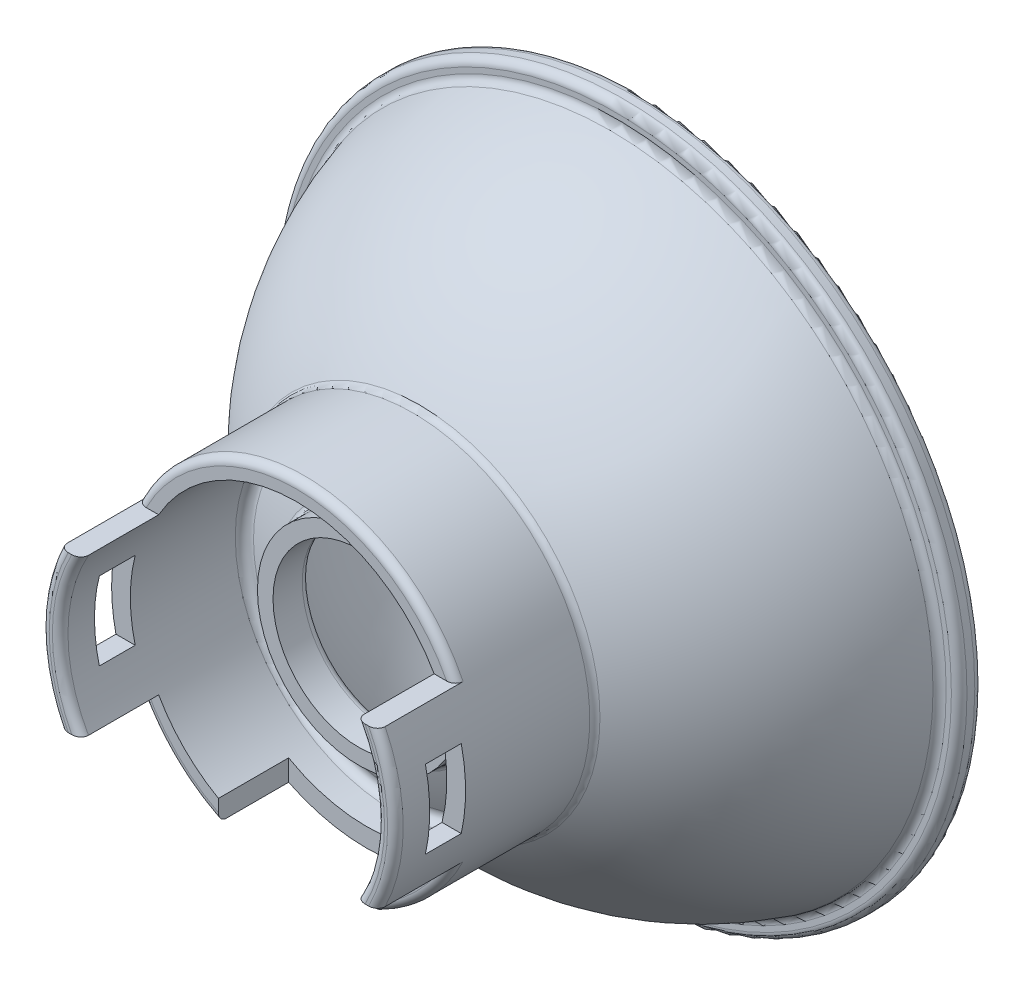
ISO-10303-21;
HEADER;
FILE_DESCRIPTION(('STEP AP214'),'2;1');
FILE_NAME('part.step','',(''),(''),'','','');
FILE_SCHEMA(('AUTOMOTIVE_DESIGN { 1 0 10303 214 1 1 1 1 }'));
ENDSEC;
DATA;
#1=APPLICATION_CONTEXT('core data for automotive mechanical design processes');
#2=APPLICATION_PROTOCOL_DEFINITION('international standard','automotive_design',2000,#1);
#3=PRODUCT_CONTEXT('',#1,'mechanical');
#4=PRODUCT('Part','Part','',(#3));
#5=PRODUCT_RELATED_PRODUCT_CATEGORY('part','',(#4));
#6=PRODUCT_DEFINITION_FORMATION('','',#4);
#7=PRODUCT_DEFINITION_CONTEXT('part definition',#1,'design');
#8=PRODUCT_DEFINITION('design','',#6,#7);
#9=PRODUCT_DEFINITION_SHAPE('','',#8);
#10=(LENGTH_UNIT() NAMED_UNIT(*) SI_UNIT(.MILLI.,.METRE.));
#11=(NAMED_UNIT(*) PLANE_ANGLE_UNIT() SI_UNIT($,.RADIAN.));
#12=(NAMED_UNIT(*) SI_UNIT($,.STERADIAN.) SOLID_ANGLE_UNIT());
#13=UNCERTAINTY_MEASURE_WITH_UNIT(LENGTH_MEASURE(1.E-05),#10,'distance_accuracy_value','');
#14=(GEOMETRIC_REPRESENTATION_CONTEXT(3) GLOBAL_UNCERTAINTY_ASSIGNED_CONTEXT((#13)) GLOBAL_UNIT_ASSIGNED_CONTEXT((#10,
#11,#12)) REPRESENTATION_CONTEXT('',''));
#15=CARTESIAN_POINT('',(0.,0.,0.));
#16=DIRECTION('',(0.,0.,1.));
#17=DIRECTION('',(1.,0.,0.));
#18=AXIS2_PLACEMENT_3D('',#15,#16,#17);
#19=CARTESIAN_POINT('',(-15.,-15.,22.));
#20=DIRECTION('',(0.,0.,1.));
#21=DIRECTION('',(1.,0.,0.));
#22=AXIS2_PLACEMENT_3D('',#19,#20,#21);
#23=PLANE('',#22);
#24=DIRECTION('',(1.,0.,0.));
#25=VECTOR('',#24,1.);
#26=CARTESIAN_POINT('',(-15.,-5.,22.));
#27=LINE('',#26,#25);
#28=CARTESIAN_POINT('',(-9.62925230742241,-5.,22.));
#29=VERTEX_POINT('',#28);
#30=CARTESIAN_POINT('',(-8.83303458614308,-5.,22.));
#31=VERTEX_POINT('',#30);
#32=EDGE_CURVE('E504',#29,#31,#27,.T.);
#33=ORIENTED_EDGE('',*,*,#32,.F.);
#34=CARTESIAN_POINT('',(0.,0.,22.));
#35=DIRECTION('',(0.,0.,1.));
#36=DIRECTION('',(1.,0.,0.));
#37=AXIS2_PLACEMENT_3D('',#34,#35,#36);
#38=CIRCLE('',#37,10.85);
#39=CARTESIAN_POINT('',(-5.,-9.62925230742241,22.));
#40=VERTEX_POINT('',#39);
#41=EDGE_CURVE('E289',#29,#40,#38,.T.);
#42=ORIENTED_EDGE('',*,*,#41,.T.);
#43=DIRECTION('',(0.,-1.,0.));
#44=VECTOR('',#43,1.);
#45=CARTESIAN_POINT('',(-5.,-15.,22.));
#46=LINE('',#45,#44);
#47=CARTESIAN_POINT('',(-5.,-8.83303458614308,22.));
#48=VERTEX_POINT('',#47);
#49=EDGE_CURVE('E220',#48,#40,#46,.T.);
#50=ORIENTED_EDGE('',*,*,#49,.F.);
#51=CARTESIAN_POINT('',(0.,0.,22.));
#52=DIRECTION('',(0.,0.,1.));
#53=DIRECTION('',(1.,0.,0.));
#54=AXIS2_PLACEMENT_3D('',#51,#52,#53);
#55=CIRCLE('',#54,10.15);
#56=EDGE_CURVE('E239',#48,#31,#55,.F.);
#57=ORIENTED_EDGE('',*,*,#56,.T.);
#58=EDGE_LOOP('',(#33,#42,#50,#57));
#59=FACE_BOUND('',#58,.T.);
#60=ADVANCED_FACE('F29',(#59),#23,.T.);
#61=CARTESIAN_POINT('',(0.,0.,0.));
#62=DIRECTION('',(0.,0.,-1.));
#63=DIRECTION('',(-1.,0.,0.));
#64=AXIS2_PLACEMENT_3D('',#61,#62,#63);
#65=CYLINDRICAL_SURFACE('',#64,11.35);
#66=CARTESIAN_POINT('',(0.,0.,14.5358436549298));
#67=DIRECTION('',(0.,0.,-1.));
#68=DIRECTION('',(-1.,0.,0.));
#69=AXIS2_PLACEMENT_3D('',#66,#67,#68);
#70=CIRCLE('',#69,11.35);
#71=CARTESIAN_POINT('',(-11.35,0.,14.5358436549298));
#72=VERTEX_POINT('',#71);
#73=EDGE_CURVE('E274',#72,#72,#70,.F.);
#74=ORIENTED_EDGE('',*,*,#73,.T.);
#75=EDGE_LOOP('',(#74));
#76=FACE_BOUND('',#75,.T.);
#77=DIRECTION('',(0.,0.,-1.));
#78=VECTOR('',#77,1.);
#79=CARTESIAN_POINT('',(10.189332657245,5.,0.));
#80=LINE('',#79,#78);
#81=CARTESIAN_POINT('',(10.189332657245,5.,26.5));
#82=VERTEX_POINT('',#81);
#83=CARTESIAN_POINT('',(10.189332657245,5.,21.5));
#84=VERTEX_POINT('',#83);
#85=EDGE_CURVE('E570',#82,#84,#80,.T.);
#86=ORIENTED_EDGE('',*,*,#85,.F.);
#87=CARTESIAN_POINT('',(0.,0.,26.5));
#88=DIRECTION('',(0.,0.,-1.));
#89=DIRECTION('',(-1.,0.,0.));
#90=AXIS2_PLACEMENT_3D('',#87,#88,#89);
#91=CIRCLE('',#90,11.35);
#92=CARTESIAN_POINT('',(10.189332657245,-5.,26.5));
#93=VERTEX_POINT('',#92);
#94=EDGE_CURVE('E452',#82,#93,#91,.T.);
#95=ORIENTED_EDGE('',*,*,#94,.T.);
#96=DIRECTION('',(0.,0.,-1.));
#97=VECTOR('',#96,1.);
#98=CARTESIAN_POINT('',(10.189332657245,-5.,0.));
#99=LINE('',#98,#97);
#100=CARTESIAN_POINT('',(10.189332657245,-5.,21.5));
#101=VERTEX_POINT('',#100);
#102=EDGE_CURVE('E559',#93,#101,#99,.T.);
#103=ORIENTED_EDGE('',*,*,#102,.T.);
#104=CARTESIAN_POINT('',(0.,0.,21.5));
#105=DIRECTION('',(0.,0.,1.));
#106=DIRECTION('',(1.,0.,0.));
#107=AXIS2_PLACEMENT_3D('',#104,#105,#106);
#108=CIRCLE('',#107,11.35);
#109=CARTESIAN_POINT('',(5.,-10.189332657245,21.5));
#110=VERTEX_POINT('',#109);
#111=EDGE_CURVE('E280',#101,#110,#108,.F.);
#112=ORIENTED_EDGE('',*,*,#111,.T.);
#113=DIRECTION('',(0.,0.,-1.));
#114=VECTOR('',#113,1.);
#115=CARTESIAN_POINT('',(5.,-10.189332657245,0.));
#116=LINE('',#115,#114);
#117=CARTESIAN_POINT('',(5.,-10.189332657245,17.5));
#118=VERTEX_POINT('',#117);
#119=EDGE_CURVE('E231',#118,#110,#116,.F.);
#120=ORIENTED_EDGE('',*,*,#119,.F.);
#121=CARTESIAN_POINT('',(0.,0.,17.5));
#122=DIRECTION('',(0.,0.,-1.));
#123=DIRECTION('',(-1.,0.,0.));
#124=AXIS2_PLACEMENT_3D('',#121,#122,#123);
#125=CIRCLE('',#124,11.35);
#126=CARTESIAN_POINT('',(-5.,-10.189332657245,17.5));
#127=VERTEX_POINT('',#126);
#128=EDGE_CURVE('E519',#127,#118,#125,.F.);
#129=ORIENTED_EDGE('',*,*,#128,.F.);
#130=DIRECTION('',(0.,0.,-1.));
#131=VECTOR('',#130,1.);
#132=CARTESIAN_POINT('',(-5.,-10.189332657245,0.));
#133=LINE('',#132,#131);
#134=CARTESIAN_POINT('',(-5.,-10.189332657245,21.5));
#135=VERTEX_POINT('',#134);
#136=EDGE_CURVE('E514',#135,#127,#133,.T.);
#137=ORIENTED_EDGE('',*,*,#136,.F.);
#138=CARTESIAN_POINT('',(0.,0.,21.5));
#139=DIRECTION('',(0.,0.,1.));
#140=DIRECTION('',(1.,0.,0.));
#141=AXIS2_PLACEMENT_3D('',#138,#139,#140);
#142=CIRCLE('',#141,11.35);
#143=CARTESIAN_POINT('',(-10.189332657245,-5.,21.5));
#144=VERTEX_POINT('',#143);
#145=EDGE_CURVE('E286',#135,#144,#142,.F.);
#146=ORIENTED_EDGE('',*,*,#145,.T.);
#147=DIRECTION('',(0.,0.,-1.));
#148=VECTOR('',#147,1.);
#149=CARTESIAN_POINT('',(-10.189332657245,-5.,0.));
#150=LINE('',#149,#148);
#151=CARTESIAN_POINT('',(-10.189332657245,-5.,26.5));
#152=VERTEX_POINT('',#151);
#153=EDGE_CURVE('E561',#144,#152,#150,.F.);
#154=ORIENTED_EDGE('',*,*,#153,.T.);
#155=CARTESIAN_POINT('',(0.,0.,26.5));
#156=DIRECTION('',(0.,0.,-1.));
#157=DIRECTION('',(-1.,0.,0.));
#158=AXIS2_PLACEMENT_3D('',#155,#156,#157);
#159=CIRCLE('',#158,11.35);
#160=CARTESIAN_POINT('',(-10.189332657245,5.,26.5));
#161=VERTEX_POINT('',#160);
#162=EDGE_CURVE('E454',#152,#161,#159,.T.);
#163=ORIENTED_EDGE('',*,*,#162,.T.);
#164=DIRECTION('',(0.,0.,-1.));
#165=VECTOR('',#164,1.);
#166=CARTESIAN_POINT('',(-10.189332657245,5.,0.));
#167=LINE('',#166,#165);
#168=CARTESIAN_POINT('',(-10.189332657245,5.,21.5));
#169=VERTEX_POINT('',#168);
#170=EDGE_CURVE('E572',#169,#161,#167,.F.);
#171=ORIENTED_EDGE('',*,*,#170,.F.);
#172=CARTESIAN_POINT('',(0.,0.,21.5));
#173=DIRECTION('',(0.,0.,1.));
#174=DIRECTION('',(1.,0.,0.));
#175=AXIS2_PLACEMENT_3D('',#172,#173,#174);
#176=CIRCLE('',#175,11.35);
#177=EDGE_CURVE('E283',#169,#84,#176,.F.);
#178=ORIENTED_EDGE('',*,*,#177,.T.);
#179=EDGE_LOOP('',(#86,#95,#103,#112,#120,#129,#137,#146,#154,#163,#171,#178));
#180=FACE_BOUND('',#179,.T.);
#181=CARTESIAN_POINT('',(0.,0.,24.8));
#182=DIRECTION('',(0.,0.,1.));
#183=DIRECTION('',(1.,0.,0.));
#184=AXIS2_PLACEMENT_3D('',#181,#182,#183);
#185=CIRCLE('',#184,11.35);
#186=CARTESIAN_POINT('',(-11.0712465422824,-2.5,24.8));
#187=VERTEX_POINT('',#186);
#188=CARTESIAN_POINT('',(-11.0712465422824,2.5,24.8));
#189=VERTEX_POINT('',#188);
#190=EDGE_CURVE('E554',#187,#189,#185,.F.);
#191=ORIENTED_EDGE('',*,*,#190,.F.);
#192=DIRECTION('',(0.,0.,-1.));
#193=VECTOR('',#192,1.);
#194=CARTESIAN_POINT('',(-11.0712465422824,-2.5,0.));
#195=LINE('',#194,#193);
#196=CARTESIAN_POINT('',(-11.0712465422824,-2.5,22.5));
#197=VERTEX_POINT('',#196);
#198=EDGE_CURVE('E543',#197,#187,#195,.F.);
#199=ORIENTED_EDGE('',*,*,#198,.F.);
#200=CARTESIAN_POINT('',(0.,0.,22.5));
#201=DIRECTION('',(0.,0.,-1.));
#202=DIRECTION('',(0.,1.,0.));
#203=AXIS2_PLACEMENT_3D('',#200,#201,#202);
#204=CIRCLE('',#203,11.35);
#205=CARTESIAN_POINT('',(-11.0712465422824,2.5,22.5));
#206=VERTEX_POINT('',#205);
#207=EDGE_CURVE('E547',#206,#197,#204,.F.);
#208=ORIENTED_EDGE('',*,*,#207,.F.);
#209=DIRECTION('',(0.,0.,-1.));
#210=VECTOR('',#209,1.);
#211=CARTESIAN_POINT('',(-11.0712465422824,2.5,0.));
#212=LINE('',#211,#210);
#213=EDGE_CURVE('E548',#189,#206,#212,.T.);
#214=ORIENTED_EDGE('',*,*,#213,.F.);
#215=EDGE_LOOP('',(#191,#199,#208,#214));
#216=FACE_BOUND('',#215,.T.);
#217=CARTESIAN_POINT('',(11.0712465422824,2.5,24.8));
#218=VERTEX_POINT('',#217);
#219=CARTESIAN_POINT('',(11.0712465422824,-2.5,24.8));
#220=VERTEX_POINT('',#219);
#221=EDGE_CURVE('E552',#218,#220,#185,.F.);
#222=ORIENTED_EDGE('',*,*,#221,.F.);
#223=DIRECTION('',(0.,0.,-1.));
#224=VECTOR('',#223,1.);
#225=CARTESIAN_POINT('',(11.0712465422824,2.5,0.));
#226=LINE('',#225,#224);
#227=CARTESIAN_POINT('',(11.0712465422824,2.5,22.5));
#228=VERTEX_POINT('',#227);
#229=EDGE_CURVE('E550',#228,#218,#226,.F.);
#230=ORIENTED_EDGE('',*,*,#229,.F.);
#231=CARTESIAN_POINT('',(11.0712465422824,-2.5,22.5));
#232=VERTEX_POINT('',#231);
#233=EDGE_CURVE('E545',#232,#228,#204,.F.);
#234=ORIENTED_EDGE('',*,*,#233,.F.);
#235=DIRECTION('',(0.,0.,-1.));
#236=VECTOR('',#235,1.);
#237=CARTESIAN_POINT('',(11.0712465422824,-2.5,0.));
#238=LINE('',#237,#236);
#239=EDGE_CURVE('E541',#220,#232,#238,.T.);
#240=ORIENTED_EDGE('',*,*,#239,.F.);
#241=EDGE_LOOP('',(#222,#230,#234,#240));
#242=FACE_BOUND('',#241,.T.);
#243=ADVANCED_FACE('F497',(#76,#180,#216,#242),#65,.T.);
#244=CARTESIAN_POINT('',(0.,0.,0.));
#245=DIRECTION('',(0.,0.,-1.));
#246=DIRECTION('',(-1.,0.,0.));
#247=AXIS2_PLACEMENT_3D('',#244,#245,#246);
#248=CYLINDRICAL_SURFACE('',#247,10.15);
#249=CARTESIAN_POINT('',(0.,0.,15.7706221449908));
#250=DIRECTION('',(0.,0.,-1.));
#251=DIRECTION('',(-1.,0.,0.));
#252=AXIS2_PLACEMENT_3D('',#249,#250,#251);
#253=CIRCLE('',#252,10.15);
#254=CARTESIAN_POINT('',(-10.15,0.,15.7706221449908));
#255=VERTEX_POINT('',#254);
#256=EDGE_CURVE('E271',#255,#255,#253,.T.);
#257=ORIENTED_EDGE('',*,*,#256,.T.);
#258=EDGE_LOOP('',(#257));
#259=FACE_BOUND('',#258,.T.);
#260=DIRECTION('',(0.,0.,-1.));
#261=VECTOR('',#260,1.);
#262=CARTESIAN_POINT('',(-8.83303458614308,5.,0.));
#263=LINE('',#262,#261);
#264=CARTESIAN_POINT('',(-8.83303458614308,5.,22.));
#265=VERTEX_POINT('',#264);
#266=CARTESIAN_POINT('',(-8.83303458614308,5.,26.5));
#267=VERTEX_POINT('',#266);
#268=EDGE_CURVE('E568',#265,#267,#263,.F.);
#269=ORIENTED_EDGE('',*,*,#268,.T.);
#270=CARTESIAN_POINT('',(0.,0.,26.5));
#271=DIRECTION('',(0.,0.,-1.));
#272=DIRECTION('',(-1.,0.,0.));
#273=AXIS2_PLACEMENT_3D('',#270,#271,#272);
#274=CIRCLE('',#273,10.15);
#275=CARTESIAN_POINT('',(-8.83303458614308,-5.,26.5));
#276=VERTEX_POINT('',#275);
#277=EDGE_CURVE('E11',#267,#276,#274,.F.);
#278=ORIENTED_EDGE('',*,*,#277,.T.);
#279=DIRECTION('',(0.,0.,-1.));
#280=VECTOR('',#279,1.);
#281=CARTESIAN_POINT('',(-8.83303458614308,-5.,0.));
#282=LINE('',#281,#280);
#283=EDGE_CURVE('E557',#31,#276,#282,.F.);
#284=ORIENTED_EDGE('',*,*,#283,.F.);
#285=ORIENTED_EDGE('',*,*,#56,.F.);
#286=DIRECTION('',(0.,0.,-1.));
#287=VECTOR('',#286,1.);
#288=CARTESIAN_POINT('',(-5.,-8.83303458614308,0.));
#289=LINE('',#288,#287);
#290=CARTESIAN_POINT('',(-5.,-8.83303458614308,17.5));
#291=VERTEX_POINT('',#290);
#292=EDGE_CURVE('E520',#48,#291,#289,.T.);
#293=ORIENTED_EDGE('',*,*,#292,.T.);
#294=CARTESIAN_POINT('',(0.,0.,17.5));
#295=DIRECTION('',(0.,0.,-1.));
#296=DIRECTION('',(-1.,0.,0.));
#297=AXIS2_PLACEMENT_3D('',#294,#295,#296);
#298=CIRCLE('',#297,10.15);
#299=CARTESIAN_POINT('',(5.,-8.83303458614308,17.5));
#300=VERTEX_POINT('',#299);
#301=EDGE_CURVE('E230',#291,#300,#298,.F.);
#302=ORIENTED_EDGE('',*,*,#301,.T.);
#303=DIRECTION('',(0.,0.,-1.));
#304=VECTOR('',#303,1.);
#305=CARTESIAN_POINT('',(5.,-8.83303458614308,0.));
#306=LINE('',#305,#304);
#307=CARTESIAN_POINT('',(5.,-8.83303458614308,22.));
#308=VERTEX_POINT('',#307);
#309=EDGE_CURVE('E214',#300,#308,#306,.F.);
#310=ORIENTED_EDGE('',*,*,#309,.T.);
#311=CARTESIAN_POINT('',(8.83303458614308,-5.,22.));
#312=VERTEX_POINT('',#311);
#313=EDGE_CURVE('E228',#312,#308,#55,.F.);
#314=ORIENTED_EDGE('',*,*,#313,.F.);
#315=DIRECTION('',(0.,0.,-1.));
#316=VECTOR('',#315,1.);
#317=CARTESIAN_POINT('',(8.83303458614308,-5.,0.));
#318=LINE('',#317,#316);
#319=CARTESIAN_POINT('',(8.83303458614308,-5.,26.5));
#320=VERTEX_POINT('',#319);
#321=EDGE_CURVE('E508',#320,#312,#318,.T.);
#322=ORIENTED_EDGE('',*,*,#321,.F.);
#323=CARTESIAN_POINT('',(0.,0.,26.5));
#324=DIRECTION('',(0.,0.,-1.));
#325=DIRECTION('',(-1.,0.,0.));
#326=AXIS2_PLACEMENT_3D('',#323,#324,#325);
#327=CIRCLE('',#326,10.15);
#328=CARTESIAN_POINT('',(8.83303458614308,5.,26.5));
#329=VERTEX_POINT('',#328);
#330=EDGE_CURVE('E37',#320,#329,#327,.F.);
#331=ORIENTED_EDGE('',*,*,#330,.T.);
#332=DIRECTION('',(0.,0.,-1.));
#333=VECTOR('',#332,1.);
#334=CARTESIAN_POINT('',(8.83303458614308,5.,0.));
#335=LINE('',#334,#333);
#336=CARTESIAN_POINT('',(8.83303458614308,5.,22.));
#337=VERTEX_POINT('',#336);
#338=EDGE_CURVE('E566',#329,#337,#335,.T.);
#339=ORIENTED_EDGE('',*,*,#338,.T.);
#340=CARTESIAN_POINT('',(0.,0.,22.));
#341=DIRECTION('',(0.,0.,1.));
#342=DIRECTION('',(1.,0.,0.));
#343=AXIS2_PLACEMENT_3D('',#340,#341,#342);
#344=CIRCLE('',#343,10.15);
#345=EDGE_CURVE('E624',#265,#337,#344,.F.);
#346=ORIENTED_EDGE('',*,*,#345,.F.);
#347=EDGE_LOOP('',(#269,#278,#284,#285,#293,#302,#310,#314,#322,#331,#339,#346));
#348=FACE_BOUND('',#347,.T.);
#349=DIRECTION('',(0.,0.,-1.));
#350=VECTOR('',#349,1.);
#351=CARTESIAN_POINT('',(-9.83730145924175,-2.5,0.));
#352=LINE('',#351,#350);
#353=CARTESIAN_POINT('',(-9.83730145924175,-2.5,22.5));
#354=VERTEX_POINT('',#353);
#355=CARTESIAN_POINT('',(-9.83730145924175,-2.5,24.8));
#356=VERTEX_POINT('',#355);
#357=EDGE_CURVE('E259',#354,#356,#352,.F.);
#358=ORIENTED_EDGE('',*,*,#357,.T.);
#359=CARTESIAN_POINT('',(0.,0.,24.8));
#360=DIRECTION('',(0.,0.,1.));
#361=DIRECTION('',(1.,0.,0.));
#362=AXIS2_PLACEMENT_3D('',#359,#360,#361);
#363=CIRCLE('',#362,10.15);
#364=CARTESIAN_POINT('',(-9.83730145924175,2.5,24.8));
#365=VERTEX_POINT('',#364);
#366=EDGE_CURVE('E221',#356,#365,#363,.F.);
#367=ORIENTED_EDGE('',*,*,#366,.T.);
#368=DIRECTION('',(0.,0.,-1.));
#369=VECTOR('',#368,1.);
#370=CARTESIAN_POINT('',(-9.83730145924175,2.5,0.));
#371=LINE('',#370,#369);
#372=CARTESIAN_POINT('',(-9.83730145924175,2.5,22.5));
#373=VERTEX_POINT('',#372);
#374=EDGE_CURVE('E262',#365,#373,#371,.T.);
#375=ORIENTED_EDGE('',*,*,#374,.T.);
#376=CARTESIAN_POINT('',(0.,0.,22.5));
#377=DIRECTION('',(0.,0.,-1.));
#378=DIRECTION('',(0.,1.,0.));
#379=AXIS2_PLACEMENT_3D('',#376,#377,#378);
#380=CIRCLE('',#379,10.15);
#381=EDGE_CURVE('E253',#373,#354,#380,.F.);
#382=ORIENTED_EDGE('',*,*,#381,.T.);
#383=EDGE_LOOP('',(#358,#367,#375,#382));
#384=FACE_BOUND('',#383,.T.);
#385=DIRECTION('',(0.,0.,-1.));
#386=VECTOR('',#385,1.);
#387=CARTESIAN_POINT('',(9.83730145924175,2.5,0.));
#388=LINE('',#387,#386);
#389=CARTESIAN_POINT('',(9.83730145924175,2.5,22.5));
#390=VERTEX_POINT('',#389);
#391=CARTESIAN_POINT('',(9.83730145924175,2.5,24.8));
#392=VERTEX_POINT('',#391);
#393=EDGE_CURVE('E252',#390,#392,#388,.F.);
#394=ORIENTED_EDGE('',*,*,#393,.T.);
#395=CARTESIAN_POINT('',(9.83730145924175,-2.5,24.8));
#396=VERTEX_POINT('',#395);
#397=EDGE_CURVE('E256',#392,#396,#363,.F.);
#398=ORIENTED_EDGE('',*,*,#397,.T.);
#399=DIRECTION('',(0.,0.,-1.));
#400=VECTOR('',#399,1.);
#401=CARTESIAN_POINT('',(9.83730145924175,-2.5,0.));
#402=LINE('',#401,#400);
#403=CARTESIAN_POINT('',(9.83730145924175,-2.5,22.5));
#404=VERTEX_POINT('',#403);
#405=EDGE_CURVE('E238',#396,#404,#402,.T.);
#406=ORIENTED_EDGE('',*,*,#405,.T.);
#407=EDGE_CURVE('E242',#404,#390,#380,.F.);
#408=ORIENTED_EDGE('',*,*,#407,.T.);
#409=EDGE_LOOP('',(#394,#398,#406,#408));
#410=FACE_BOUND('',#409,.T.);
#411=ADVANCED_FACE('F225',(#259,#348,#384,#410),#248,.F.);
#412=CARTESIAN_POINT('',(0.,10.15,27.));
#413=DIRECTION('',(0.,0.,-1.));
#414=DIRECTION('',(-1.,0.,0.));
#415=AXIS2_PLACEMENT_3D('',#412,#413,#414);
#416=PLANE('',#415);
#417=DIRECTION('',(-1.,0.,0.));
#418=VECTOR('',#417,1.);
#419=CARTESIAN_POINT('',(0.,-5.,27.));
#420=LINE('',#419,#418);
#421=CARTESIAN_POINT('',(9.62925230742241,-5.,27.));
#422=VERTEX_POINT('',#421);
#423=CARTESIAN_POINT('',(9.4033238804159,-5.,27.));
#424=VERTEX_POINT('',#423);
#425=EDGE_CURVE('E245',#422,#424,#420,.T.);
#426=ORIENTED_EDGE('',*,*,#425,.F.);
#427=CARTESIAN_POINT('',(0.,0.,27.));
#428=DIRECTION('',(0.,0.,-1.));
#429=DIRECTION('',(-1.,0.,0.));
#430=AXIS2_PLACEMENT_3D('',#427,#428,#429);
#431=CIRCLE('',#430,10.85);
#432=CARTESIAN_POINT('',(9.62925230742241,5.,27.));
#433=VERTEX_POINT('',#432);
#434=EDGE_CURVE('E442',#422,#433,#431,.F.);
#435=ORIENTED_EDGE('',*,*,#434,.T.);
#436=DIRECTION('',(-1.,0.,0.));
#437=VECTOR('',#436,1.);
#438=CARTESIAN_POINT('',(0.,5.,27.));
#439=LINE('',#438,#437);
#440=CARTESIAN_POINT('',(9.4033238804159,5.,27.));
#441=VERTEX_POINT('',#440);
#442=EDGE_CURVE('E623',#433,#441,#439,.T.);
#443=ORIENTED_EDGE('',*,*,#442,.T.);
#444=CARTESIAN_POINT('',(0.,0.,27.));
#445=DIRECTION('',(0.,0.,-1.));
#446=DIRECTION('',(-1.,0.,0.));
#447=AXIS2_PLACEMENT_3D('',#444,#445,#446);
#448=CIRCLE('',#447,10.65);
#449=EDGE_CURVE('E443',#441,#424,#448,.T.);
#450=ORIENTED_EDGE('',*,*,#449,.T.);
#451=EDGE_LOOP('',(#426,#435,#443,#450));
#452=FACE_BOUND('',#451,.T.);
#453=ADVANCED_FACE('F422',(#452),#416,.F.);
#454=CARTESIAN_POINT('',(-9.4033238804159,5.,27.));
#455=VERTEX_POINT('',#454);
#456=CARTESIAN_POINT('',(-9.62925230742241,5.,27.));
#457=VERTEX_POINT('',#456);
#458=EDGE_CURVE('E622',#455,#457,#439,.T.);
#459=ORIENTED_EDGE('',*,*,#458,.T.);
#460=CARTESIAN_POINT('',(0.,0.,27.));
#461=DIRECTION('',(0.,0.,-1.));
#462=DIRECTION('',(-1.,0.,0.));
#463=AXIS2_PLACEMENT_3D('',#460,#461,#462);
#464=CIRCLE('',#463,10.85);
#465=CARTESIAN_POINT('',(-9.62925230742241,-5.,27.));
#466=VERTEX_POINT('',#465);
#467=EDGE_CURVE('E50',#457,#466,#464,.F.);
#468=ORIENTED_EDGE('',*,*,#467,.T.);
#469=CARTESIAN_POINT('',(-9.4033238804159,-5.,27.));
#470=VERTEX_POINT('',#469);
#471=EDGE_CURVE('E247',#470,#466,#420,.T.);
#472=ORIENTED_EDGE('',*,*,#471,.F.);
#473=CARTESIAN_POINT('',(0.,0.,27.));
#474=DIRECTION('',(0.,0.,-1.));
#475=DIRECTION('',(-1.,0.,0.));
#476=AXIS2_PLACEMENT_3D('',#473,#474,#475);
#477=CIRCLE('',#476,10.65);
#478=EDGE_CURVE('E638',#470,#455,#477,.T.);
#479=ORIENTED_EDGE('',*,*,#478,.T.);
#480=EDGE_LOOP('',(#459,#468,#472,#479));
#481=FACE_BOUND('',#480,.T.);
#482=ADVANCED_FACE('F641',(#481),#416,.F.);
#483=CARTESIAN_POINT('',(0.,0.,-4.));
#484=DIRECTION('',(0.,0.,-1.));
#485=DIRECTION('',(0.,1.,0.));
#486=AXIS2_PLACEMENT_3D('',#483,#484,#485);
#487=SPHERICAL_SURFACE('',#486,21.5);
#488=CARTESIAN_POINT('',(0.,0.,15.3212898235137));
#489=DIRECTION('',(0.,0.,-1.));
#490=DIRECTION('',(-1.,0.,0.));
#491=AXIS2_PLACEMENT_3D('',#488,#489,#490);
#492=CIRCLE('',#491,9.43068181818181);
#493=CARTESIAN_POINT('',(0.,9.43068181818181,15.3212898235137));
#494=VERTEX_POINT('',#493);
#495=EDGE_CURVE('E268',#494,#494,#492,.F.);
#496=CARTESIAN_POINT('',(0.,0.,16.3826387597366));
#497=DIRECTION('',(0.,0.,-1.));
#498=DIRECTION('',(-1.,0.,0.));
#499=AXIS2_PLACEMENT_3D('',#496,#497,#498);
#500=CIRCLE('',#499,6.84090909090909);
#501=CARTESIAN_POINT('',(0.,6.84090909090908,16.3826387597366));
#502=VERTEX_POINT('',#501);
#503=EDGE_CURVE('E616',#502,#502,#500,.T.);
#504=CARTESIAN_POINT('',(0.,9.43068181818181,15.3212898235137));
#505=CARTESIAN_POINT('',(0.,9.40446329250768,15.334087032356));
#506=CARTESIAN_POINT('',(0.,9.3782187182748,15.3468308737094));
#507=CARTESIAN_POINT('',(0.,9.32567790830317,15.3722116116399));
#508=CARTESIAN_POINT('',(0.,9.29938167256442,15.384848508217));
#509=CARTESIAN_POINT('',(0.,9.24673797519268,15.4100151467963));
#510=CARTESIAN_POINT('',(0.,9.22039051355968,15.4225448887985));
#511=CARTESIAN_POINT('',(0.,9.16764480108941,15.44749701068));
#512=CARTESIAN_POINT('',(0.,9.14124655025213,15.4599193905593));
#513=CARTESIAN_POINT('',(0.,9.0883996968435,15.4846565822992));
#514=CARTESIAN_POINT('',(0.,9.06195109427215,15.4969713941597));
#515=CARTESIAN_POINT('',(0.,9.00900397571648,15.5214932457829));
#516=CARTESIAN_POINT('',(0.,8.98250545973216,15.5337002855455));
#517=CARTESIAN_POINT('',(0.,8.92945895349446,15.5580063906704));
#518=CARTESIAN_POINT('',(0.,8.90291096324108,15.5701054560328));
#519=CARTESIAN_POINT('',(0.,8.84976594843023,15.594195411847));
#520=CARTESIAN_POINT('',(0.,8.82316892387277,15.6061863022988));
#521=CARTESIAN_POINT('',(0.,8.76992628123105,15.6300597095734));
#522=CARTESIAN_POINT('',(0.,8.74328066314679,15.6419422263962));
#523=CARTESIAN_POINT('',(0.,8.68994127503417,15.6655986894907));
#524=CARTESIAN_POINT('',(0.,8.6632475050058,15.6773726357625));
#525=CARTESIAN_POINT('',(0.,8.6098122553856,15.7008117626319));
#526=CARTESIAN_POINT('',(0.,8.58307077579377,15.7124769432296));
#527=CARTESIAN_POINT('',(0.,8.52954055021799,15.7356983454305));
#528=CARTESIAN_POINT('',(0.,8.50275180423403,15.7472545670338));
#529=CARTESIAN_POINT('',(0.,8.44912748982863,15.7702578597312));
#530=CARTESIAN_POINT('',(0.,8.42229192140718,15.7817049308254));
#531=CARTESIAN_POINT('',(0.,8.36857440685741,15.8044897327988));
#532=CARTESIAN_POINT('',(0.,8.34169246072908,15.8158274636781));
#533=CARTESIAN_POINT('',(0.,8.28788263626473,15.8383933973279));
#534=CARTESIAN_POINT('',(0.,8.26095475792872,15.8496216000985));
#535=CARTESIAN_POINT('',(0.,8.2070535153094,15.8719682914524));
#536=CARTESIAN_POINT('',(0.,8.1800801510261,15.8830867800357));
#537=CARTESIAN_POINT('',(0.,8.12608838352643,15.9052138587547));
#538=CARTESIAN_POINT('',(0.,8.09906998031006,15.9162224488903));
#539=CARTESIAN_POINT('',(0.,8.04498858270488,15.9381295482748));
#540=CARTESIAN_POINT('',(0.,8.01792558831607,15.9490280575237));
#541=CARTESIAN_POINT('',(0.,7.9637554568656,15.9707148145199));
#542=CARTESIAN_POINT('',(0.,7.93664831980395,15.9815030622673));
#543=CARTESIAN_POINT('',(0.,7.88239035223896,16.0029691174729));
#544=CARTESIAN_POINT('',(0.,7.85523952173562,16.0136469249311));
#545=CARTESIAN_POINT('',(0.,7.80089461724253,16.0348919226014));
#546=CARTESIAN_POINT('',(0.,7.77370054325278,16.0454591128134));
#547=CARTESIAN_POINT('',(0.,7.71926960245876,16.0664827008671));
#548=CARTESIAN_POINT('',(0.,7.6920327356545,16.0769390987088));
#549=CARTESIAN_POINT('',(0.,7.63751666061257,16.097740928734));
#550=CARTESIAN_POINT('',(0.,7.61023745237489,16.1080863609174));
#551=CARTESIAN_POINT('',(0.,7.55563714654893,16.1286660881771));
#552=CARTESIAN_POINT('',(0.,7.52831604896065,16.1389003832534));
#553=CARTESIAN_POINT('',(0.,7.47363241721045,16.1592576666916));
#554=CARTESIAN_POINT('',(0.,7.44626988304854,16.1693806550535));
#555=CARTESIAN_POINT('',(0.,7.39150383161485,16.1895151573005));
#556=CARTESIAN_POINT('',(0.,7.36410031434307,16.1995266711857));
#557=CARTESIAN_POINT('',(0.,7.30925275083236,16.2194380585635));
#558=CARTESIAN_POINT('',(0.,7.28180870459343,16.2293379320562));
#559=CARTESIAN_POINT('',(0.,7.22688053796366,16.2490258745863));
#560=CARTESIAN_POINT('',(0.,7.19939641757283,16.2588139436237));
#561=CARTESIAN_POINT('',(0.,7.14438855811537,16.2782781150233));
#562=CARTESIAN_POINT('',(0.,7.11686481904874,16.2879542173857));
#563=CARTESIAN_POINT('',(0.,7.06177817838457,16.307194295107));
#564=CARTESIAN_POINT('',(0.,7.03421527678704,16.316758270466));
#565=CARTESIAN_POINT('',(0.,6.97905076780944,16.3357739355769));
#566=CARTESIAN_POINT('',(0.,6.95144916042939,16.3452256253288));
#567=CARTESIAN_POINT('',(0.,6.89620769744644,16.3640165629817));
#568=CARTESIAN_POINT('',(0.,6.86856784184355,16.3733558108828));
#569=CARTESIAN_POINT('',(0.,6.84090909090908,16.3826387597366));
#570=B_SPLINE_CURVE_WITH_KNOTS('',3,(#504,#505,#506,#507,#508,#509,#510,#511,#512,#513,#514,
#515,#516,#517,#518,#519,#520,#521,#522,#523,#524,#525,#526,#527,#528,#529,#530,#531,#532,#533,
#534,#535,#536,#537,#538,#539,#540,#541,#542,#543,#544,#545,#546,#547,#548,#549,#550,#551,#552,
#553,#554,#555,#556,#557,#558,#559,#560,#561,#562,#563,#564,#565,#566,#567,#568,#569),
.UNSPECIFIED.,.F.,.F.,(4,2,2,2,2,2,2,2,2,2,2,2,2,2,2,2,2,2,2,2,2,2,2,2,2,2,2,2,2,2,2,2,4),(0.,
0.0875248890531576,0.175049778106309,0.262574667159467,0.350099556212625,0.437624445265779,
0.525149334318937,0.612674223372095,0.700199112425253,0.787724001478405,0.875248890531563,
0.96277377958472,1.05029866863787,1.13782355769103,1.22534844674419,1.31287333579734,
1.4003982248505,1.48792311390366,1.57544800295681,1.66297289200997,1.75049778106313,
1.83802267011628,1.92554755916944,2.0130724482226,2.10059733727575,2.18812222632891,
2.27564711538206,2.36317200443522,2.45069689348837,2.53822178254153,2.62574667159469,
2.71327156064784,2.800796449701),.UNSPECIFIED.);
#571=EDGE_CURVE('BSEAM703',#494,#502,#570,.T.);
#572=ORIENTED_EDGE('',*,*,#495,.T.);
#573=ORIENTED_EDGE('',*,*,#503,.T.);
#574=ORIENTED_EDGE('',*,*,#571,.T.);
#575=ORIENTED_EDGE('',*,*,#571,.F.);
#576=EDGE_LOOP('',(#572,#574,#573,#575));
#577=FACE_BOUND('',#576,.T.);
#578=ADVANCED_FACE('F703',(#577),#487,.T.);
#579=CARTESIAN_POINT('',(0.,0.,1.5));
#580=DIRECTION('',(0.,0.,-1.));
#581=DIRECTION('',(-1.,0.,0.));
#582=AXIS2_PLACEMENT_3D('',#579,#580,#581);
#583=CYLINDRICAL_SURFACE('',#582,20.);
#584=CARTESIAN_POINT('',(0.,0.,0.5));
#585=DIRECTION('',(0.,0.,1.));
#586=DIRECTION('',(1.,0.,0.));
#587=AXIS2_PLACEMENT_3D('',#584,#585,#586);
#588=CIRCLE('',#587,20.);
#589=CARTESIAN_POINT('',(20.,0.,0.5));
#590=VERTEX_POINT('',#589);
#591=EDGE_CURVE('E598',#590,#590,#588,.F.);
#592=ORIENTED_EDGE('',*,*,#591,.T.);
#593=EDGE_LOOP('',(#592));
#594=FACE_BOUND('',#593,.T.);
#595=CARTESIAN_POINT('',(0.,0.,0.64417210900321));
#596=DIRECTION('',(0.,0.,1.));
#597=DIRECTION('',(1.,0.,0.));
#598=AXIS2_PLACEMENT_3D('',#595,#596,#597);
#599=CIRCLE('',#598,20.);
#600=CARTESIAN_POINT('',(20.,0.,0.64417210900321));
#601=VERTEX_POINT('',#600);
#602=EDGE_CURVE('E583',#601,#601,#599,.T.);
#603=ORIENTED_EDGE('',*,*,#602,.T.);
#604=EDGE_LOOP('',(#603));
#605=FACE_BOUND('',#604,.T.);
#606=ADVANCED_FACE('F723',(#594,#605),#583,.F.);
#607=CARTESIAN_POINT('',(0.,0.,1.5));
#608=DIRECTION('',(0.,0.,1.));
#609=DIRECTION('',(1.,0.,0.));
#610=AXIS2_PLACEMENT_3D('',#607,#608,#609);
#611=PLANE('',#610);
#612=CARTESIAN_POINT('',(0.,0.,1.5));
#613=DIRECTION('',(0.,0.,1.));
#614=DIRECTION('',(1.,0.,0.));
#615=AXIS2_PLACEMENT_3D('',#612,#613,#614);
#616=CIRCLE('',#615,21.5);
#617=CARTESIAN_POINT('',(21.5,0.,1.5));
#618=VERTEX_POINT('',#617);
#619=EDGE_CURVE('E610',#618,#618,#616,.T.);
#620=ORIENTED_EDGE('',*,*,#619,.T.);
#621=EDGE_LOOP('',(#620));
#622=FACE_BOUND('',#621,.T.);
#623=CARTESIAN_POINT('',(0.,0.,1.5));
#624=DIRECTION('',(0.,0.,1.));
#625=DIRECTION('',(1.,0.,0.));
#626=AXIS2_PLACEMENT_3D('',#623,#624,#625);
#627=CIRCLE('',#626,21.1660104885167);
#628=CARTESIAN_POINT('',(21.1660104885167,0.,1.5));
#629=VERTEX_POINT('',#628);
#630=EDGE_CURVE('E607',#629,#629,#627,.F.);
#631=ORIENTED_EDGE('',*,*,#630,.T.);
#632=EDGE_LOOP('',(#631));
#633=FACE_BOUND('',#632,.T.);
#634=ADVANCED_FACE('F726',(#622,#633),#611,.T.);
#635=CARTESIAN_POINT('',(0.,0.,0.));
#636=DIRECTION('',(0.,0.,1.));
#637=DIRECTION('',(1.,0.,0.));
#638=AXIS2_PLACEMENT_3D('',#635,#636,#637);
#639=PLANE('',#638);
#640=CARTESIAN_POINT('',(0.,0.,0.));
#641=DIRECTION('',(0.,0.,1.));
#642=DIRECTION('',(1.,0.,0.));
#643=AXIS2_PLACEMENT_3D('',#640,#641,#642);
#644=CIRCLE('',#643,20.5);
#645=CARTESIAN_POINT('',(20.5,0.,0.));
#646=VERTEX_POINT('',#645);
#647=EDGE_CURVE('E595',#646,#646,#644,.T.);
#648=ORIENTED_EDGE('',*,*,#647,.T.);
#649=EDGE_LOOP('',(#648));
#650=FACE_BOUND('',#649,.T.);
#651=CARTESIAN_POINT('',(0.,0.,0.));
#652=DIRECTION('',(0.,0.,1.));
#653=DIRECTION('',(1.,0.,0.));
#654=AXIS2_PLACEMENT_3D('',#651,#652,#653);
#655=CIRCLE('',#654,21.5);
#656=CARTESIAN_POINT('',(21.5,0.,0.));
#657=VERTEX_POINT('',#656);
#658=EDGE_CURVE('E592',#657,#657,#655,.F.);
#659=ORIENTED_EDGE('',*,*,#658,.T.);
#660=EDGE_LOOP('',(#659));
#661=FACE_BOUND('',#660,.T.);
#662=ADVANCED_FACE('F728',(#650,#661),#639,.F.);
#663=CARTESIAN_POINT('',(0.,0.,1.5));
#664=DIRECTION('',(0.,0.,-1.));
#665=DIRECTION('',(-1.,0.,0.));
#666=AXIS2_PLACEMENT_3D('',#663,#664,#665);
#667=CYLINDRICAL_SURFACE('',#666,22.);
#668=CARTESIAN_POINT('',(0.,0.,0.5));
#669=DIRECTION('',(0.,0.,1.));
#670=DIRECTION('',(1.,0.,0.));
#671=AXIS2_PLACEMENT_3D('',#668,#669,#670);
#672=CIRCLE('',#671,22.);
#673=CARTESIAN_POINT('',(22.,0.,0.5));
#674=VERTEX_POINT('',#673);
#675=EDGE_CURVE('E604',#674,#674,#672,.T.);
#676=ORIENTED_EDGE('',*,*,#675,.T.);
#677=EDGE_LOOP('',(#676));
#678=FACE_BOUND('',#677,.T.);
#679=CARTESIAN_POINT('',(0.,0.,1.));
#680=DIRECTION('',(0.,0.,1.));
#681=DIRECTION('',(1.,0.,0.));
#682=AXIS2_PLACEMENT_3D('',#679,#680,#681);
#683=CIRCLE('',#682,22.);
#684=CARTESIAN_POINT('',(22.,0.,1.));
#685=VERTEX_POINT('',#684);
#686=EDGE_CURVE('E601',#685,#685,#683,.F.);
#687=ORIENTED_EDGE('',*,*,#686,.T.);
#688=EDGE_LOOP('',(#687));
#689=FACE_BOUND('',#688,.T.);
#690=ADVANCED_FACE('F31',(#678,#689),#667,.T.);
#691=CARTESIAN_POINT('',(0.,0.,0.));
#692=DIRECTION('',(0.,0.,-1.));
#693=DIRECTION('',(-1.,0.,0.));
#694=AXIS2_PLACEMENT_3D('',#691,#692,#693);
#695=CYLINDRICAL_SURFACE('',#694,6.5);
#696=CARTESIAN_POINT('',(0.,0.,16.8566536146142));
#697=DIRECTION('',(0.,0.,-1.));
#698=DIRECTION('',(-1.,0.,0.));
#699=AXIS2_PLACEMENT_3D('',#696,#697,#698);
#700=CIRCLE('',#699,6.5);
#701=CARTESIAN_POINT('',(-6.5,0.,16.8566536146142));
#702=VERTEX_POINT('',#701);
#703=EDGE_CURVE('E619',#702,#702,#700,.F.);
#704=ORIENTED_EDGE('',*,*,#703,.T.);
#705=EDGE_LOOP('',(#704));
#706=FACE_BOUND('',#705,.T.);
#707=CARTESIAN_POINT('',(0.,0.,18.));
#708=DIRECTION('',(0.,0.,-1.));
#709=DIRECTION('',(-1.,0.,0.));
#710=AXIS2_PLACEMENT_3D('',#707,#708,#709);
#711=CIRCLE('',#710,6.5);
#712=CARTESIAN_POINT('',(-6.5,0.,18.));
#713=VERTEX_POINT('',#712);
#714=EDGE_CURVE('E580',#713,#713,#711,.T.);
#715=ORIENTED_EDGE('',*,*,#714,.T.);
#716=EDGE_LOOP('',(#715));
#717=FACE_BOUND('',#716,.T.);
#718=ADVANCED_FACE('F718',(#706,#717),#695,.T.);
#719=CARTESIAN_POINT('',(0.,5.5,18.));
#720=DIRECTION('',(0.,0.,-1.));
#721=DIRECTION('',(-1.,0.,0.));
#722=AXIS2_PLACEMENT_3D('',#719,#720,#721);
#723=PLANE('',#722);
#724=ORIENTED_EDGE('',*,*,#714,.F.);
#725=EDGE_LOOP('',(#724));
#726=FACE_BOUND('',#725,.T.);
#727=CARTESIAN_POINT('',(0.,0.,18.));
#728=DIRECTION('',(0.,0.,-1.));
#729=DIRECTION('',(-1.,0.,0.));
#730=AXIS2_PLACEMENT_3D('',#727,#728,#729);
#731=CIRCLE('',#730,5.5);
#732=CARTESIAN_POINT('',(-5.5,0.,18.));
#733=VERTEX_POINT('',#732);
#734=EDGE_CURVE('E577',#733,#733,#731,.T.);
#735=ORIENTED_EDGE('',*,*,#734,.T.);
#736=EDGE_LOOP('',(#735));
#737=FACE_BOUND('',#736,.T.);
#738=ADVANCED_FACE('F714',(#726,#737),#723,.F.);
#739=CARTESIAN_POINT('',(0.,0.,0.));
#740=DIRECTION('',(0.,0.,-1.));
#741=DIRECTION('',(-1.,0.,0.));
#742=AXIS2_PLACEMENT_3D('',#739,#740,#741);
#743=CYLINDRICAL_SURFACE('',#742,5.5);
#744=CARTESIAN_POINT('',(0.,0.,16.1246117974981));
#745=DIRECTION('',(0.,0.,-1.));
#746=DIRECTION('',(-1.,0.,0.));
#747=AXIS2_PLACEMENT_3D('',#744,#745,#746);
#748=CIRCLE('',#747,5.5);
#749=CARTESIAN_POINT('',(-5.5,0.,16.1246117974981));
#750=VERTEX_POINT('',#749);
#751=EDGE_CURVE('E586',#750,#750,#748,.T.);
#752=ORIENTED_EDGE('',*,*,#751,.T.);
#753=EDGE_LOOP('',(#752));
#754=FACE_BOUND('',#753,.T.);
#755=ORIENTED_EDGE('',*,*,#734,.F.);
#756=EDGE_LOOP('',(#755));
#757=FACE_BOUND('',#756,.T.);
#758=ADVANCED_FACE('F710',(#754,#757),#743,.F.);
#759=CARTESIAN_POINT('',(0.,0.,-4.));
#760=DIRECTION('',(0.,0.,-1.));
#761=DIRECTION('',(0.,1.,0.));
#762=AXIS2_PLACEMENT_3D('',#759,#760,#761);
#763=SPHERICAL_SURFACE('',#762,20.5);
#764=CARTESIAN_POINT('',(0.,0.,15.6454543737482));
#765=DIRECTION('',(0.,0.,-1.));
#766=DIRECTION('',(-1.,0.,0.));
#767=AXIS2_PLACEMENT_3D('',#764,#765,#766);
#768=CIRCLE('',#767,5.85714285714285);
#769=CARTESIAN_POINT('',(0.,5.85714285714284,15.6454543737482));
#770=VERTEX_POINT('',#769);
#771=EDGE_CURVE('E589',#770,#770,#768,.F.);
#772=CARTESIAN_POINT('',(0.,0.,0.636904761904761));
#773=DIRECTION('',(0.,0.,-1.));
#774=DIRECTION('',(-1.,0.,0.));
#775=AXIS2_PLACEMENT_3D('',#772,#773,#774);
#776=CIRCLE('',#775,19.9687033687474);
#777=CARTESIAN_POINT('',(0.,19.9687033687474,0.636904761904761));
#778=VERTEX_POINT('',#777);
#779=EDGE_CURVE('E574',#778,#778,#776,.T.);
#780=CARTESIAN_POINT('',(0.,5.85714285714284,15.6454543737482));
#781=CARTESIAN_POINT('',(0.,6.07260475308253,15.5812175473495));
#782=CARTESIAN_POINT('',(0.,6.28700896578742,15.5134334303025));
#783=CARTESIAN_POINT('',(0.,6.71347193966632,15.3708499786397));
#784=CARTESIAN_POINT('',(0.,6.92553070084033,15.296050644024));
#785=CARTESIAN_POINT('',(0.,7.34707268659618,15.1395161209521));
#786=CARTESIAN_POINT('',(0.,7.55655591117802,15.0577809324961));
#787=CARTESIAN_POINT('',(0.,7.97272020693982,14.8874636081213));
#788=CARTESIAN_POINT('',(0.,8.17940127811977,14.7988814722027));
#789=CARTESIAN_POINT('',(0.,8.58973750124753,14.6149660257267));
#790=CARTESIAN_POINT('',(0.,8.79339265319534,14.5196327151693));
#791=CARTESIAN_POINT('',(0.,9.19745659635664,14.3223181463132));
#792=CARTESIAN_POINT('',(0.,9.39786538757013,14.2203368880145));
#793=CARTESIAN_POINT('',(0.,9.7952196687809,14.0098368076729));
#794=CARTESIAN_POINT('',(0.,9.99216515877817,13.90131798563));
#795=CARTESIAN_POINT('',(0.,10.382379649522,13.6778602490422));
#796=CARTESIAN_POINT('',(0.,10.5756486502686,13.5629213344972));
#797=CARTESIAN_POINT('',(0.,10.9583009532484,13.3267478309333));
#798=CARTESIAN_POINT('',(0.,11.1476842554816,13.2055132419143));
#799=CARTESIAN_POINT('',(0.,11.5223601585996,12.9568796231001));
#800=CARTESIAN_POINT('',(0.,11.7076527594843,12.8294805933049));
#801=CARTESIAN_POINT('',(0.,12.0739466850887,12.5686559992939));
#802=CARTESIAN_POINT('',(0.,12.2549480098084,12.4352304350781));
#803=CARTESIAN_POINT('',(0.,12.612463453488,12.1624972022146));
#804=CARTESIAN_POINT('',(0.,12.7889775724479,12.023189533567));
#805=CARTESIAN_POINT('',(0.,13.1373275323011,11.7388428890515));
#806=CARTESIAN_POINT('',(0.,13.3091633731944,11.5938039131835));
#807=CARTESIAN_POINT('',(0.,13.6479707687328,11.2981516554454));
#808=CARTESIAN_POINT('',(0.,13.8149423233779,11.1475383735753));
#809=CARTESIAN_POINT('',(0.,14.1438404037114,10.8409005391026));
#810=CARTESIAN_POINT('',(0.,14.3057669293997,10.6848759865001));
#811=CARTESIAN_POINT('',(0.,14.6243996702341,10.3675845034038));
#812=CARTESIAN_POINT('',(0.,14.7811058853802,10.20631757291));
#813=CARTESIAN_POINT('',(0.,15.0891283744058,9.87871590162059));
#814=CARTESIAN_POINT('',(0.,15.2404446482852,9.71238116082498));
#815=CARTESIAN_POINT('',(0.,15.5375234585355,9.37482392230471));
#816=CARTESIAN_POINT('',(0.,15.6832859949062,9.20360142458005));
#817=CARTESIAN_POINT('',(0.,15.9690995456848,8.85645401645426));
#818=CARTESIAN_POINT('',(0.,16.1091505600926,8.68052910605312));
#819=CARTESIAN_POINT('',(0.,16.3833894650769,8.32416730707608));
#820=CARTESIAN_POINT('',(0.,16.5175773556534,8.14373041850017));
#821=CARTESIAN_POINT('',(0.,16.779944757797,7.77853998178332));
#822=CARTESIAN_POINT('',(0.,16.908124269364,7.59378643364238));
#823=CARTESIAN_POINT('',(0.,17.1583361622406,7.22016266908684));
#824=CARTESIAN_POINT('',(0.,17.2803685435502,7.03129245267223));
#825=CARTESIAN_POINT('',(0.,17.5181540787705,6.6496397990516));
#826=CARTESIAN_POINT('',(0.,17.6339072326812,6.45685736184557));
#827=CARTESIAN_POINT('',(0.,17.8590090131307,6.06758894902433));
#828=CARTESIAN_POINT('',(0.,17.9683576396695,5.87110297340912));
#829=CARTESIAN_POINT('',(0.,18.180531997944,5.47464017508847));
#830=CARTESIAN_POINT('',(0.,18.2833577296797,5.27466335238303));
#831=CARTESIAN_POINT('',(0.,18.4823749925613,4.87143533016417));
#832=CARTESIAN_POINT('',(0.,18.5785665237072,4.66818413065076));
#833=CARTESIAN_POINT('',(0.,18.764211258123,4.2586273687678));
#834=CARTESIAN_POINT('',(0.,18.8536644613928,4.05232180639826));
#835=CARTESIAN_POINT('',(0.,19.0257357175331,3.63687964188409));
#836=CARTESIAN_POINT('',(0.,19.1083537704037,3.42774303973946));
#837=CARTESIAN_POINT('',(0.,19.2666652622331,3.00686517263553));
#838=CARTESIAN_POINT('',(0.,19.3423587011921,2.79512390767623));
#839=CARTESIAN_POINT('',(0.,19.4867391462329,2.36926595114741));
#840=CARTESIAN_POINT('',(0.,19.5554261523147,2.15514925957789));
#841=CARTESIAN_POINT('',(0.,19.6857189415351,1.72477210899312));
#842=CARTESIAN_POINT('',(0.,19.7473247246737,1.50851164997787));
#843=CARTESIAN_POINT('',(0.,19.8633900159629,1.07408149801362));
#844=CARTESIAN_POINT('',(0.,19.9178495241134,0.85591180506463));
#845=CARTESIAN_POINT('',(0.,19.9687033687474,0.636904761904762));
#846=B_SPLINE_CURVE_WITH_KNOTS('',3,(#780,#781,#782,#783,#784,#785,#786,#787,#788,#789,#790,
#791,#792,#793,#794,#795,#796,#797,#798,#799,#800,#801,#802,#803,#804,#805,#806,#807,#808,#809,
#810,#811,#812,#813,#814,#815,#816,#817,#818,#819,#820,#821,#822,#823,#824,#825,#826,#827,#828,
#829,#830,#831,#832,#833,#834,#835,#836,#837,#838,#839,#840,#841,#842,#843,#844,#845),
.UNSPECIFIED.,.F.,.F.,(4,2,2,2,2,2,2,2,2,2,2,2,2,2,2,2,2,2,2,2,2,2,2,2,2,2,2,2,2,2,2,2,4),(0.,
0.674470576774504,1.34894115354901,2.02341173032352,2.69788230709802,3.37235288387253,
4.04682346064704,4.72129403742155,5.39576461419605,6.07023519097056,6.74470576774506,
7.41917634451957,8.09364692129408,8.76811749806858,9.44258807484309,10.1170586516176,
10.7915292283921,11.4659998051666,12.1404703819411,12.8149409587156,13.4894115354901,
14.1638821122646,14.8383526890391,15.5128232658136,16.1872938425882,16.8617644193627,
17.5362349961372,18.2107055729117,18.8851761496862,19.5596467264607,20.2341173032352,
20.9085878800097,21.5830584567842),.UNSPECIFIED.);
#847=EDGE_CURVE('BSEAM706',#770,#778,#846,.T.);
#848=ORIENTED_EDGE('',*,*,#771,.T.);
#849=ORIENTED_EDGE('',*,*,#779,.T.);
#850=ORIENTED_EDGE('',*,*,#847,.T.);
#851=ORIENTED_EDGE('',*,*,#847,.F.);
#852=EDGE_LOOP('',(#848,#850,#849,#851));
#853=FACE_BOUND('',#852,.T.);
#854=ADVANCED_FACE('F706',(#853),#763,.F.);
#855=CARTESIAN_POINT('',(0.,0.,0.863095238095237));
#856=DIRECTION('',(0.,0.,1.));
#857=DIRECTION('',(1.,0.,0.));
#858=AXIS2_PLACEMENT_3D('',#855,#856,#857);
#859=CONICAL_SURFACE('',#858,20.9427864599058,1.34263131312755);
#860=ORIENTED_EDGE('',*,*,#602,.F.);
#861=EDGE_LOOP('',(#860));
#862=FACE_BOUND('',#861,.T.);
#863=ORIENTED_EDGE('',*,*,#779,.F.);
#864=EDGE_LOOP('',(#863));
#865=FACE_BOUND('',#864,.T.);
#866=ADVANCED_FACE('F701',(#862,#865),#859,.T.);
#867=CARTESIAN_POINT('',(0.,0.,14.1145744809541));
#868=DIRECTION('',(0.,0.,-1.));
#869=DIRECTION('',(-1.,0.,0.));
#870=AXIS2_PLACEMENT_3D('',#867,#868,#869);
#871=CIRCLE('',#870,11.5806818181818);
#872=CARTESIAN_POINT('',(0.,11.5806818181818,14.1145744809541));
#873=VERTEX_POINT('',#872);
#874=EDGE_CURVE('E277',#873,#873,#871,.T.);
#875=CARTESIAN_POINT('',(0.,0.,1.86363636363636));
#876=DIRECTION('',(0.,0.,-1.));
#877=DIRECTION('',(-1.,0.,0.));
#878=AXIS2_PLACEMENT_3D('',#875,#876,#877);
#879=CIRCLE('',#878,20.6849647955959);
#880=CARTESIAN_POINT('',(0.,20.6849647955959,1.86363636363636));
#881=VERTEX_POINT('',#880);
#882=EDGE_CURVE('E613',#881,#881,#879,.F.);
#883=CARTESIAN_POINT('',(0.,11.5806818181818,14.1145744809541));
#884=CARTESIAN_POINT('',(0.,11.7176266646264,14.0270257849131));
#885=CARTESIAN_POINT('',(0.,11.8535783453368,13.9379235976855));
#886=CARTESIAN_POINT('',(0.,12.1234262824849,13.7566593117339));
#887=CARTESIAN_POINT('',(0.,12.2573225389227,13.6644972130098));
#888=CARTESIAN_POINT('',(0.,12.5229905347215,13.4771601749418));
#889=CARTESIAN_POINT('',(0.,12.6547622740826,13.3819852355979));
#890=CARTESIAN_POINT('',(0.,12.9161135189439,13.1886715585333));
#891=CARTESIAN_POINT('',(0.,13.0456930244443,13.0905328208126));
#892=CARTESIAN_POINT('',(0.,13.3025931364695,12.8913420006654));
#893=CARTESIAN_POINT('',(0.,13.4299137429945,12.790289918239));
#894=CARTESIAN_POINT('',(0.,13.6822305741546,12.5853243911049));
#895=CARTESIAN_POINT('',(0.,13.8072267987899,12.4814109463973));
#896=CARTESIAN_POINT('',(0.,14.0548305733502,12.2707761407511));
#897=CARTESIAN_POINT('',(0.,14.1774381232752,12.1640547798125));
#898=CARTESIAN_POINT('',(0.,14.4202014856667,11.9478590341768));
#899=CARTESIAN_POINT('',(0.,14.5403572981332,11.8383846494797));
#900=CARTESIAN_POINT('',(0.,14.7781553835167,11.6167391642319));
#901=CARTESIAN_POINT('',(0.,14.8957976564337,11.5045680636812));
#902=CARTESIAN_POINT('',(0.,15.1285081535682,11.2775868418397));
#903=CARTESIAN_POINT('',(0.,15.2435763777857,11.162776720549));
#904=CARTESIAN_POINT('',(0.,15.4710795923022,10.9305765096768));
#905=CARTESIAN_POINT('',(0.,15.5835145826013,10.8131864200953));
#906=CARTESIAN_POINT('',(0.,15.8056934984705,10.5758866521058));
#907=CARTESIAN_POINT('',(0.,15.9154374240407,10.4559769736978));
#908=CARTESIAN_POINT('',(0.,16.1321777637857,10.2136997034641));
#909=CARTESIAN_POINT('',(0.,16.2391741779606,10.0913321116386));
#910=CARTESIAN_POINT('',(0.,16.4503644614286,9.84420195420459));
#911=CARTESIAN_POINT('',(0.,16.5545583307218,9.71943938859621));
#912=CARTESIAN_POINT('',(0.,16.7600899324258,9.46758345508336));
#913=CARTESIAN_POINT('',(0.,16.8614276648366,9.34049008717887));
#914=CARTESIAN_POINT('',(0.,17.0611948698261,9.08403791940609));
#915=CARTESIAN_POINT('',(0.,17.1596243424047,8.95467911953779));
#916=CARTESIAN_POINT('',(0.,17.3535244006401,8.69376262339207));
#917=CARTESIAN_POINT('',(0.,17.4489949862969,8.56220492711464));
#918=CARTESIAN_POINT('',(0.,17.6369281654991,8.29695830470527));
#919=CARTESIAN_POINT('',(0.,17.7293907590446,8.16326937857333));
#920=CARTESIAN_POINT('',(0.,17.9112603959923,7.89382905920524));
#921=CARTESIAN_POINT('',(0.,18.0006674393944,7.75807766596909));
#922=CARTESIAN_POINT('',(0.,18.1763799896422,7.48458223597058));
#923=CARTESIAN_POINT('',(0.,18.2626854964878,7.34683819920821));
#924=CARTESIAN_POINT('',(0.,18.432150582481,7.06942833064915));
#925=CARTESIAN_POINT('',(0.,18.5153101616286,6.92976249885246));
#926=CARTESIAN_POINT('',(0.,18.6784406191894,6.64858087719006));
#927=CARTESIAN_POINT('',(0.,18.7584114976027,6.50706508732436));
#928=CARTESIAN_POINT('',(0.,18.9151234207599,6.22225633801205));
#929=CARTESIAN_POINT('',(0.,18.9918644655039,6.07896337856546));
#930=CARTESIAN_POINT('',(0.,19.1420772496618,5.79067399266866));
#931=CARTESIAN_POINT('',(0.,19.2155489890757,5.64567756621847));
#932=CARTESIAN_POINT('',(0.,19.3591853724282,5.35405582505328));
#933=CARTESIAN_POINT('',(0.,19.4293500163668,5.2074305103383));
#934=CARTESIAN_POINT('',(0.,19.5663361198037,4.91262640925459));
#935=CARTESIAN_POINT('',(0.,19.633157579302,4.76444762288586));
#936=CARTESIAN_POINT('',(0.,19.7634229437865,4.46661279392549));
#937=CARTESIAN_POINT('',(0.,19.8268668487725,4.31695675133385));
#938=CARTESIAN_POINT('',(0.,19.9503444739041,4.01624438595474));
#939=CARTESIAN_POINT('',(0.,20.0103781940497,3.86518806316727));
#940=CARTESIAN_POINT('',(0.,20.1270045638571,3.56175283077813));
#941=CARTESIAN_POINT('',(0.,20.1835972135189,3.40937392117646));
#942=CARTESIAN_POINT('',(0.,20.2933123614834,3.10337189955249));
#943=CARTESIAN_POINT('',(0.,20.3464348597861,2.94974878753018));
#944=CARTESIAN_POINT('',(0.,20.4491822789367,2.64133734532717));
#945=CARTESIAN_POINT('',(0.,20.4988071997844,2.48654901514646));
#946=CARTESIAN_POINT('',(0.,20.5945343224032,2.17588686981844));
#947=CARTESIAN_POINT('',(0.,20.6406365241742,2.02001305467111));
#948=CARTESIAN_POINT('',(0.,20.6849647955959,1.86363636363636));
#949=B_SPLINE_CURVE_WITH_KNOTS('',3,(#883,#884,#885,#886,#887,#888,#889,#890,#891,#892,#893,
#894,#895,#896,#897,#898,#899,#900,#901,#902,#903,#904,#905,#906,#907,#908,#909,#910,#911,#912,
#913,#914,#915,#916,#917,#918,#919,#920,#921,#922,#923,#924,#925,#926,#927,#928,#929,#930,#931,
#932,#933,#934,#935,#936,#937,#938,#939,#940,#941,#942,#943,#944,#945,#946,#947,#948),
.UNSPECIFIED.,.F.,.F.,(4,2,2,2,2,2,2,2,2,2,2,2,2,2,2,2,2,2,2,2,2,2,2,2,2,2,2,2,2,2,2,2,4),(0.,
0.487604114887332,0.975208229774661,1.46281234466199,1.95041645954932,2.43802057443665,
2.92562468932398,3.41322880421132,3.90083291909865,4.38843703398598,4.87604114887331,
5.36364526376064,5.85124937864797,6.3388534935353,6.82645760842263,7.31406172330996,
7.80166583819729,8.28926995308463,8.77687406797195,9.26447818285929,9.75208229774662,
10.2396864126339,10.7272905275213,11.2148946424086,11.7024987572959,12.1901028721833,
12.6777069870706,13.1653111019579,13.6529152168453,14.1405193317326,14.6281234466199,
15.1157275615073,15.6033316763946),.UNSPECIFIED.);
#950=EDGE_CURVE('BSEAM697',#873,#881,#949,.T.);
#951=ORIENTED_EDGE('',*,*,#874,.T.);
#952=ORIENTED_EDGE('',*,*,#882,.T.);
#953=ORIENTED_EDGE('',*,*,#950,.T.);
#954=ORIENTED_EDGE('',*,*,#950,.F.);
#955=EDGE_LOOP('',(#951,#953,#952,#954));
#956=FACE_BOUND('',#955,.T.);
#957=ADVANCED_FACE('F697',(#956),#487,.T.);
#958=CARTESIAN_POINT('',(0.,0.,16.1246117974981));
#959=DIRECTION('',(0.,0.,-1.));
#960=DIRECTION('',(-1.,0.,0.));
#961=AXIS2_PLACEMENT_3D('',#958,#959,#960);
#962=TOROIDAL_SURFACE('',#961,6.,0.5);
#963=ORIENTED_EDGE('',*,*,#771,.F.);
#964=EDGE_LOOP('',(#963));
#965=FACE_BOUND('',#964,.T.);
#966=ORIENTED_EDGE('',*,*,#751,.F.);
#967=EDGE_LOOP('',(#966));
#968=FACE_BOUND('',#967,.T.);
#969=ADVANCED_FACE('F693',(#965,#968),#962,.T.);
#970=CARTESIAN_POINT('',(0.,0.,0.5));
#971=DIRECTION('',(0.,0.,1.));
#972=DIRECTION('',(1.,0.,0.));
#973=AXIS2_PLACEMENT_3D('',#970,#971,#972);
#974=TOROIDAL_SURFACE('',#973,20.5,0.5);
#975=ORIENTED_EDGE('',*,*,#591,.F.);
#976=EDGE_LOOP('',(#975));
#977=FACE_BOUND('',#976,.T.);
#978=ORIENTED_EDGE('',*,*,#647,.F.);
#979=EDGE_LOOP('',(#978));
#980=FACE_BOUND('',#979,.T.);
#981=ADVANCED_FACE('F689',(#977,#980),#974,.T.);
#982=CARTESIAN_POINT('',(0.,0.,0.5));
#983=DIRECTION('',(0.,0.,1.));
#984=DIRECTION('',(1.,0.,0.));
#985=AXIS2_PLACEMENT_3D('',#982,#983,#984);
#986=TOROIDAL_SURFACE('',#985,21.5,0.5);
#987=ORIENTED_EDGE('',*,*,#658,.F.);
#988=EDGE_LOOP('',(#987));
#989=FACE_BOUND('',#988,.T.);
#990=ORIENTED_EDGE('',*,*,#675,.F.);
#991=EDGE_LOOP('',(#990));
#992=FACE_BOUND('',#991,.T.);
#993=ADVANCED_FACE('F685',(#989,#992),#986,.T.);
#994=CARTESIAN_POINT('',(0.,0.,1.));
#995=DIRECTION('',(0.,0.,1.));
#996=DIRECTION('',(1.,0.,0.));
#997=AXIS2_PLACEMENT_3D('',#994,#995,#996);
#998=TOROIDAL_SURFACE('',#997,21.5,0.5);
#999=ORIENTED_EDGE('',*,*,#686,.F.);
#1000=EDGE_LOOP('',(#999));
#1001=FACE_BOUND('',#1000,.T.);
#1002=ORIENTED_EDGE('',*,*,#619,.F.);
#1003=EDGE_LOOP('',(#1002));
#1004=FACE_BOUND('',#1003,.T.);
#1005=ADVANCED_FACE('F681',(#1001,#1004),#998,.T.);
#1006=CARTESIAN_POINT('',(0.,0.,2.));
#1007=DIRECTION('',(0.,0.,1.));
#1008=DIRECTION('',(1.,0.,0.));
#1009=AXIS2_PLACEMENT_3D('',#1006,#1007,#1008);
#1010=TOROIDAL_SURFACE('',#1009,21.1660104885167,0.5);
#1011=ORIENTED_EDGE('',*,*,#630,.F.);
#1012=EDGE_LOOP('',(#1011));
#1013=FACE_BOUND('',#1012,.T.);
#1014=ORIENTED_EDGE('',*,*,#882,.F.);
#1015=EDGE_LOOP('',(#1014));
#1016=FACE_BOUND('',#1015,.T.);
#1017=ADVANCED_FACE('F677',(#1013,#1016),#1010,.F.);
#1018=CARTESIAN_POINT('',(0.,0.,16.8566536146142));
#1019=DIRECTION('',(0.,0.,-1.));
#1020=DIRECTION('',(-1.,0.,0.));
#1021=AXIS2_PLACEMENT_3D('',#1018,#1019,#1020);
#1022=TOROIDAL_SURFACE('',#1021,7.,0.5);
#1023=ORIENTED_EDGE('',*,*,#703,.F.);
#1024=EDGE_LOOP('',(#1023));
#1025=FACE_BOUND('',#1024,.T.);
#1026=ORIENTED_EDGE('',*,*,#503,.F.);
#1027=EDGE_LOOP('',(#1026));
#1028=FACE_BOUND('',#1027,.T.);
#1029=ADVANCED_FACE('F674',(#1025,#1028),#1022,.F.);
#1030=CARTESIAN_POINT('',(-15.,15.,22.));
#1031=DIRECTION('',(0.,0.,1.));
#1032=DIRECTION('',(1.,0.,0.));
#1033=AXIS2_PLACEMENT_3D('',#1030,#1031,#1032);
#1034=PLANE('',#1033);
#1035=DIRECTION('',(1.,0.,0.));
#1036=VECTOR('',#1035,1.);
#1037=CARTESIAN_POINT('',(-15.,5.,22.));
#1038=LINE('',#1037,#1036);
#1039=CARTESIAN_POINT('',(9.62925230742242,5.,22.));
#1040=VERTEX_POINT('',#1039);
#1041=EDGE_CURVE('E563',#337,#1040,#1038,.T.);
#1042=ORIENTED_EDGE('',*,*,#1041,.T.);
#1043=CARTESIAN_POINT('',(0.,0.,22.));
#1044=DIRECTION('',(0.,0.,1.));
#1045=DIRECTION('',(1.,0.,0.));
#1046=AXIS2_PLACEMENT_3D('',#1043,#1044,#1045);
#1047=CIRCLE('',#1046,10.85);
#1048=CARTESIAN_POINT('',(-9.62925230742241,5.,22.));
#1049=VERTEX_POINT('',#1048);
#1050=EDGE_CURVE('E298',#1040,#1049,#1047,.T.);
#1051=ORIENTED_EDGE('',*,*,#1050,.T.);
#1052=EDGE_CURVE('E565',#1049,#265,#1038,.T.);
#1053=ORIENTED_EDGE('',*,*,#1052,.T.);
#1054=ORIENTED_EDGE('',*,*,#345,.T.);
#1055=EDGE_LOOP('',(#1042,#1051,#1053,#1054));
#1056=FACE_BOUND('',#1055,.T.);
#1057=ADVANCED_FACE('F342',(#1056),#1034,.T.);
#1058=CARTESIAN_POINT('',(-15.,5.,22.));
#1059=DIRECTION('',(0.,-1.,0.));
#1060=DIRECTION('',(1.,0.,0.));
#1061=AXIS2_PLACEMENT_3D('',#1058,#1059,#1060);
#1062=PLANE('',#1061);
#1063=ORIENTED_EDGE('',*,*,#170,.T.);
#1064=CARTESIAN_POINT('',(-10.189332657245,5.,26.5));
#1065=CARTESIAN_POINT('',(-10.189367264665,5.,26.5260429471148));
#1066=CARTESIAN_POINT('',(-10.187068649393,5.,26.5520628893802));
#1067=CARTESIAN_POINT('',(-10.1780800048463,5.,26.6032436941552));
#1068=CARTESIAN_POINT('',(-10.1714051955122,5.,26.6284072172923));
#1069=CARTESIAN_POINT('',(-10.1539400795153,5.,26.6772403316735));
#1070=CARTESIAN_POINT('',(-10.1431517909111,5.,26.7009106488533));
#1071=CARTESIAN_POINT('',(-10.1179012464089,5.,26.7462086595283));
#1072=CARTESIAN_POINT('',(-10.1034368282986,5.,26.7678351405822));
#1073=CARTESIAN_POINT('',(-10.0707142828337,5.,26.8093980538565));
#1074=CARTESIAN_POINT('',(-10.0523288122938,5.,26.8292339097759));
#1075=CARTESIAN_POINT('',(-10.0127561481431,5.,26.8658667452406));
#1076=CARTESIAN_POINT('',(-9.99156838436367,5.,26.8826631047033));
#1077=CARTESIAN_POINT('',(-9.94482333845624,5.,26.9144726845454));
#1078=CARTESIAN_POINT('',(-9.91904161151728,5.,26.9291557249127));
#1079=CARTESIAN_POINT('',(-9.86554144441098,5.,26.9544592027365));
#1080=CARTESIAN_POINT('',(-9.83782124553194,5.,26.9650758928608));
#1081=CARTESIAN_POINT('',(-9.78028124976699,5.,26.9824221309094));
#1082=CARTESIAN_POINT('',(-9.75042331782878,5.,26.9890245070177));
#1083=CARTESIAN_POINT('',(-9.69012203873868,5.,26.9978121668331));
#1084=CARTESIAN_POINT('',(-9.65967995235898,5.,27.0000060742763));
#1085=CARTESIAN_POINT('',(-9.62925230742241,5.,27.));
#1086=B_SPLINE_CURVE_WITH_KNOTS('',3,(#1064,#1065,#1066,#1067,#1068,#1069,#1070,#1071,#1072,
#1073,#1074,#1075,#1076,#1077,#1078,#1079,#1080,#1081,#1082,#1083,#1084,#1085),.UNSPECIFIED.,
.F.,.F.,(4,2,2,2,2,2,2,2,2,2,4),(0.,0.0779916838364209,0.155713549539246,0.233397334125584,
0.311126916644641,0.391928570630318,0.472746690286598,0.561390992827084,0.650116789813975,
0.741524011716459,0.832752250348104),.UNSPECIFIED.);
#1087=EDGE_CURVE('E408',#161,#457,#1086,.T.);
#1088=ORIENTED_EDGE('',*,*,#1087,.T.);
#1089=ORIENTED_EDGE('',*,*,#458,.F.);
#1090=CARTESIAN_POINT('',(-9.4033238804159,5.,27.));
#1091=CARTESIAN_POINT('',(-9.36783629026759,5.,27.0000051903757));
#1092=CARTESIAN_POINT('',(-9.33233553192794,5.,26.9970539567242));
#1093=CARTESIAN_POINT('',(-9.2621930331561,5.,26.9852956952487));
#1094=CARTESIAN_POINT('',(-9.22755469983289,5.,26.9764683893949));
#1095=CARTESIAN_POINT('',(-9.16023064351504,5.,26.9529978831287));
#1096=CARTESIAN_POINT('',(-9.12754802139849,5.,26.9383457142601));
#1097=CARTESIAN_POINT('',(-9.06537496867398,5.,26.9033941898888));
#1098=CARTESIAN_POINT('',(-9.035880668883,5.,26.883101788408));
#1099=CARTESIAN_POINT('',(-8.9831968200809,5.,26.8387407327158));
#1100=CARTESIAN_POINT('',(-8.9597159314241,5.,26.8150198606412));
#1101=CARTESIAN_POINT('',(-8.91781113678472,5.,26.7634355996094));
#1102=CARTESIAN_POINT('',(-8.89938422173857,5.,26.7355746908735));
#1103=CARTESIAN_POINT('',(-8.87080582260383,5.,26.6805348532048));
#1104=CARTESIAN_POINT('',(-8.85988032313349,5.,26.6537567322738));
#1105=CARTESIAN_POINT('',(-8.8433806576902,5.,26.5986333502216));
#1106=CARTESIAN_POINT('',(-8.83779112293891,5.,26.5702928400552));
#1107=CARTESIAN_POINT('',(-8.834370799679,5.,26.5347944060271));
#1108=CARTESIAN_POINT('',(-8.83386966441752,5.,26.5278401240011));
#1109=CARTESIAN_POINT('',(-8.8332021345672,5.,26.5139249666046));
#1110=CARTESIAN_POINT('',(-8.83303528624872,5.,26.5069641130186));
#1111=CARTESIAN_POINT('',(-8.83303458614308,5.,26.5));
#1112=B_SPLINE_CURVE_WITH_KNOTS('',3,(#1090,#1091,#1092,#1093,#1094,#1095,#1096,#1097,#1098,
#1099,#1100,#1101,#1102,#1103,#1104,#1105,#1106,#1107,#1108,#1109,#1110,#1111),.UNSPECIFIED.,
.F.,.F.,(4,2,2,2,2,2,2,2,2,2,4),(0.,0.106364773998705,0.213098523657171,0.319997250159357,
0.426764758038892,0.526318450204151,0.625812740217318,0.712093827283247,0.798125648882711,
0.819037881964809,0.839921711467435),.UNSPECIFIED.);
#1113=EDGE_CURVE('E402',#455,#267,#1112,.T.);
#1114=ORIENTED_EDGE('',*,*,#1113,.T.);
#1115=ORIENTED_EDGE('',*,*,#268,.F.);
#1116=ORIENTED_EDGE('',*,*,#1052,.F.);
#1117=CARTESIAN_POINT('',(-9.62925230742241,5.,22.));
#1118=CARTESIAN_POINT('',(-9.66384022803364,5.,22.0000103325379));
#1119=CARTESIAN_POINT('',(-9.69845170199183,5.,21.9971726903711));
#1120=CARTESIAN_POINT('',(-9.76685308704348,5.,21.9858021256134));
#1121=CARTESIAN_POINT('',(-9.80063951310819,5.,21.9772483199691));
#1122=CARTESIAN_POINT('',(-9.86632065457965,5.,21.9544228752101));
#1123=CARTESIAN_POINT('',(-9.89821134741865,5.,21.9401395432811));
#1124=CARTESIAN_POINT('',(-9.95884250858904,5.,21.9060281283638));
#1125=CARTESIAN_POINT('',(-9.98758769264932,5.,21.8862085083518));
#1126=CARTESIAN_POINT('',(-10.03877889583,5.,21.8430279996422));
#1127=CARTESIAN_POINT('',(-10.0615319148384,5.,21.8200322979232));
#1128=CARTESIAN_POINT('',(-10.1022598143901,5.,21.770110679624));
#1129=CARTESIAN_POINT('',(-10.1202360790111,5.,21.7431859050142));
#1130=CARTESIAN_POINT('',(-10.148711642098,5.,21.6894949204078));
#1131=CARTESIAN_POINT('',(-10.1598257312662,5.,21.6630536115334));
#1132=CARTESIAN_POINT('',(-10.1769445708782,5.,21.6085941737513));
#1133=CARTESIAN_POINT('',(-10.1829613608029,5.,21.5805799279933));
#1134=CARTESIAN_POINT('',(-10.1872961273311,5.,21.5436111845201));
#1135=CARTESIAN_POINT('',(-10.1880598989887,5.,21.5348997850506));
#1136=CARTESIAN_POINT('',(-10.1890774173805,5.,21.5174603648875));
#1137=CARTESIAN_POINT('',(-10.1893319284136,5.,21.508732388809));
#1138=CARTESIAN_POINT('',(-10.189332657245,5.,21.5));
#1139=B_SPLINE_CURVE_WITH_KNOTS('',3,(#1117,#1118,#1119,#1120,#1121,#1122,#1123,#1124,#1125,
#1126,#1127,#1128,#1129,#1130,#1131,#1132,#1133,#1134,#1135,#1136,#1137,#1138),.UNSPECIFIED.,
.F.,.F.,(4,2,2,2,2,2,2,2,2,2,4),(0.,0.103686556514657,0.207754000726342,0.312034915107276,
0.416157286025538,0.512661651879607,0.60913802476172,0.694728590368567,0.780116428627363,
0.806340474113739,0.832525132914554),.UNSPECIFIED.);
#1140=EDGE_CURVE('E432',#1049,#169,#1139,.T.);
#1141=ORIENTED_EDGE('',*,*,#1140,.T.);
#1142=EDGE_LOOP('',(#1063,#1088,#1089,#1114,#1115,#1116,#1141));
#1143=FACE_BOUND('',#1142,.T.);
#1144=ADVANCED_FACE('F417',(#1143),#1062,.F.);
#1145=ORIENTED_EDGE('',*,*,#442,.F.);
#1146=CARTESIAN_POINT('',(9.62925230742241,5.,27.));
#1147=CARTESIAN_POINT('',(9.66384022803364,5.,27.0000103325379));
#1148=CARTESIAN_POINT('',(9.69845170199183,5.,26.9971726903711));
#1149=CARTESIAN_POINT('',(9.76685308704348,5.,26.9858021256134));
#1150=CARTESIAN_POINT('',(9.80063951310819,5.,26.9772483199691));
#1151=CARTESIAN_POINT('',(9.86632065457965,5.,26.9544228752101));
#1152=CARTESIAN_POINT('',(9.89821134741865,5.,26.9401395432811));
#1153=CARTESIAN_POINT('',(9.95884250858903,5.,26.9060281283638));
#1154=CARTESIAN_POINT('',(9.98758769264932,5.,26.8862085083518));
#1155=CARTESIAN_POINT('',(10.03877889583,5.,26.8430279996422));
#1156=CARTESIAN_POINT('',(10.0615319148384,5.,26.8200322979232));
#1157=CARTESIAN_POINT('',(10.1022598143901,5.,26.770110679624));
#1158=CARTESIAN_POINT('',(10.1202360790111,5.,26.7431859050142));
#1159=CARTESIAN_POINT('',(10.148711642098,5.,26.6894949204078));
#1160=CARTESIAN_POINT('',(10.1598257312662,5.,26.6630536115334));
#1161=CARTESIAN_POINT('',(10.1769445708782,5.,26.6085941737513));
#1162=CARTESIAN_POINT('',(10.1829613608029,5.,26.5805799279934));
#1163=CARTESIAN_POINT('',(10.1872961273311,5.,26.5436111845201));
#1164=CARTESIAN_POINT('',(10.1880598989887,5.,26.5348997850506));
#1165=CARTESIAN_POINT('',(10.1890774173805,5.,26.5174603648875));
#1166=CARTESIAN_POINT('',(10.1893319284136,5.,26.508732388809));
#1167=CARTESIAN_POINT('',(10.189332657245,5.,26.5));
#1168=B_SPLINE_CURVE_WITH_KNOTS('',3,(#1146,#1147,#1148,#1149,#1150,#1151,#1152,#1153,#1154,
#1155,#1156,#1157,#1158,#1159,#1160,#1161,#1162,#1163,#1164,#1165,#1166,#1167),.UNSPECIFIED.,
.F.,.F.,(4,2,2,2,2,2,2,2,2,2,4),(0.,0.103686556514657,0.207754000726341,0.312034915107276,
0.416157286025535,0.512661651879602,0.609138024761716,0.694728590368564,0.78011642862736,
0.806340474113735,0.832525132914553),.UNSPECIFIED.);
#1169=EDGE_CURVE('E409',#433,#82,#1168,.T.);
#1170=ORIENTED_EDGE('',*,*,#1169,.T.);
#1171=ORIENTED_EDGE('',*,*,#85,.T.);
#1172=CARTESIAN_POINT('',(10.189332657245,5.,21.5));
#1173=CARTESIAN_POINT('',(10.189367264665,5.,21.5260429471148));
#1174=CARTESIAN_POINT('',(10.187068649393,5.,21.5520628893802));
#1175=CARTESIAN_POINT('',(10.1780800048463,5.,21.6032436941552));
#1176=CARTESIAN_POINT('',(10.1714051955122,5.,21.6284072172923));
#1177=CARTESIAN_POINT('',(10.1539400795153,5.,21.6772403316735));
#1178=CARTESIAN_POINT('',(10.1431517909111,5.,21.7009106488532));
#1179=CARTESIAN_POINT('',(10.1179012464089,5.,21.7462086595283));
#1180=CARTESIAN_POINT('',(10.1034368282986,5.,21.7678351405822));
#1181=CARTESIAN_POINT('',(10.0707142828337,5.,21.8093980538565));
#1182=CARTESIAN_POINT('',(10.0523288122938,5.,21.8292339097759));
#1183=CARTESIAN_POINT('',(10.0127561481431,5.,21.8658667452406));
#1184=CARTESIAN_POINT('',(9.99156838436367,5.,21.8826631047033));
#1185=CARTESIAN_POINT('',(9.94482333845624,5.,21.9144726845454));
#1186=CARTESIAN_POINT('',(9.91904161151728,5.,21.9291557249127));
#1187=CARTESIAN_POINT('',(9.86554144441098,5.,21.9544592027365));
#1188=CARTESIAN_POINT('',(9.83782124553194,5.,21.9650758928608));
#1189=CARTESIAN_POINT('',(9.78028124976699,5.,21.9824221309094));
#1190=CARTESIAN_POINT('',(9.75042331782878,5.,21.9890245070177));
#1191=CARTESIAN_POINT('',(9.69012203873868,5.,21.9978121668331));
#1192=CARTESIAN_POINT('',(9.65967995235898,5.,22.0000060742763));
#1193=CARTESIAN_POINT('',(9.62925230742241,5.,22.));
#1194=B_SPLINE_CURVE_WITH_KNOTS('',3,(#1172,#1173,#1174,#1175,#1176,#1177,#1178,#1179,#1180,
#1181,#1182,#1183,#1184,#1185,#1186,#1187,#1188,#1189,#1190,#1191,#1192,#1193),.UNSPECIFIED.,
.F.,.F.,(4,2,2,2,2,2,2,2,2,2,4),(0.,0.0779916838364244,0.155713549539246,0.233397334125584,
0.311126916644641,0.391928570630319,0.472746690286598,0.561390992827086,0.650116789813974,
0.741524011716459,0.832752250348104),.UNSPECIFIED.);
#1195=EDGE_CURVE('E426',#84,#1040,#1194,.T.);
#1196=ORIENTED_EDGE('',*,*,#1195,.T.);
#1197=ORIENTED_EDGE('',*,*,#1041,.F.);
#1198=ORIENTED_EDGE('',*,*,#338,.F.);
#1199=CARTESIAN_POINT('',(8.83303458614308,5.,26.5));
#1200=CARTESIAN_POINT('',(8.83299601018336,5.,26.525569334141));
#1201=CARTESIAN_POINT('',(8.83528565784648,5.,26.5511094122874));
#1202=CARTESIAN_POINT('',(8.8442083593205,5.,26.6013099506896));
#1203=CARTESIAN_POINT('',(8.85082259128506,5.,26.6259737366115));
#1204=CARTESIAN_POINT('',(8.86807867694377,5.,26.6738130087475));
#1205=CARTESIAN_POINT('',(8.8787170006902,5.,26.6969897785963));
#1206=CARTESIAN_POINT('',(8.90354626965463,5.,26.7413654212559));
#1207=CARTESIAN_POINT('',(8.91774024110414,5.,26.7625625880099));
#1208=CARTESIAN_POINT('',(8.94996813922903,5.,26.8036174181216));
#1209=CARTESIAN_POINT('',(8.96816355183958,5.,26.8233478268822));
#1210=CARTESIAN_POINT('',(9.00727678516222,5.,26.8598800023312));
#1211=CARTESIAN_POINT('',(9.02819526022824,5.,26.8766810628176));
#1212=CARTESIAN_POINT('',(9.07489134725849,5.,26.9090581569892));
#1213=CARTESIAN_POINT('',(9.10095011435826,5.,26.9242285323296));
#1214=CARTESIAN_POINT('',(9.15505141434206,5.,26.9505168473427));
#1215=CARTESIAN_POINT('',(9.18309581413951,5.,26.9616309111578));
#1216=CARTESIAN_POINT('',(9.24273798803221,5.,26.9804208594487));
#1217=CARTESIAN_POINT('',(9.27444203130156,5.,26.9877592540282));
#1218=CARTESIAN_POINT('',(9.33854342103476,5.,26.9975470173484));
#1219=CARTESIAN_POINT('',(9.37093952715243,5.,27.0000044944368));
#1220=CARTESIAN_POINT('',(9.4033238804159,5.,27.));
#1221=B_SPLINE_CURVE_WITH_KNOTS('',3,(#1199,#1200,#1201,#1202,#1203,#1204,#1205,#1206,#1207,
#1208,#1209,#1210,#1211,#1212,#1213,#1214,#1215,#1216,#1217,#1218,#1219,#1220),.UNSPECIFIED.,
.F.,.F.,(4,2,2,2,2,2,2,2,2,2,4),(0.,0.0765597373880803,0.152788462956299,0.228950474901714,
0.305177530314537,0.385374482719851,0.465590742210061,0.555685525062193,0.645866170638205,
0.74311042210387,0.840192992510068),.UNSPECIFIED.);
#1222=EDGE_CURVE('E437',#329,#441,#1221,.T.);
#1223=ORIENTED_EDGE('',*,*,#1222,.T.);
#1224=EDGE_LOOP('',(#1145,#1170,#1171,#1196,#1197,#1198,#1223));
#1225=FACE_BOUND('',#1224,.T.);
#1226=ADVANCED_FACE('F336',(#1225),#1062,.F.);
#1227=DIRECTION('',(0.,1.,0.));
#1228=VECTOR('',#1227,1.);
#1229=CARTESIAN_POINT('',(5.,-15.,22.));
#1230=LINE('',#1229,#1228);
#1231=CARTESIAN_POINT('',(5.,-9.62925230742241,22.));
#1232=VERTEX_POINT('',#1231);
#1233=EDGE_CURVE('E209',#1232,#308,#1230,.T.);
#1234=ORIENTED_EDGE('',*,*,#1233,.F.);
#1235=CARTESIAN_POINT('',(0.,0.,22.));
#1236=DIRECTION('',(0.,0.,1.));
#1237=DIRECTION('',(1.,0.,0.));
#1238=AXIS2_PLACEMENT_3D('',#1235,#1236,#1237);
#1239=CIRCLE('',#1238,10.85);
#1240=CARTESIAN_POINT('',(9.62925230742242,-5.,22.));
#1241=VERTEX_POINT('',#1240);
#1242=EDGE_CURVE('E473',#1232,#1241,#1239,.T.);
#1243=ORIENTED_EDGE('',*,*,#1242,.T.);
#1244=EDGE_CURVE('E237',#312,#1241,#27,.T.);
#1245=ORIENTED_EDGE('',*,*,#1244,.F.);
#1246=ORIENTED_EDGE('',*,*,#313,.T.);
#1247=EDGE_LOOP('',(#1234,#1243,#1245,#1246));
#1248=FACE_BOUND('',#1247,.T.);
#1249=ADVANCED_FACE('F235',(#1248),#23,.T.);
#1250=CARTESIAN_POINT('',(-15.,-5.,22.));
#1251=DIRECTION('',(0.,-1.,0.));
#1252=DIRECTION('',(1.,0.,0.));
#1253=AXIS2_PLACEMENT_3D('',#1250,#1251,#1252);
#1254=PLANE('',#1253);
#1255=ORIENTED_EDGE('',*,*,#471,.T.);
#1256=CARTESIAN_POINT('',(-9.62925230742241,-5.,27.));
#1257=CARTESIAN_POINT('',(-9.66384022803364,-5.,27.0000103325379));
#1258=CARTESIAN_POINT('',(-9.69845170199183,-5.,26.9971726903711));
#1259=CARTESIAN_POINT('',(-9.76685308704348,-5.,26.9858021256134));
#1260=CARTESIAN_POINT('',(-9.80063951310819,-5.,26.9772483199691));
#1261=CARTESIAN_POINT('',(-9.86632065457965,-5.,26.9544228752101));
#1262=CARTESIAN_POINT('',(-9.89821134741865,-5.,26.9401395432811));
#1263=CARTESIAN_POINT('',(-9.95884250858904,-5.,26.9060281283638));
#1264=CARTESIAN_POINT('',(-9.98758769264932,-5.,26.8862085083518));
#1265=CARTESIAN_POINT('',(-10.03877889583,-5.,26.8430279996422));
#1266=CARTESIAN_POINT('',(-10.0615319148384,-5.,26.8200322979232));
#1267=CARTESIAN_POINT('',(-10.1022598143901,-5.,26.770110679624));
#1268=CARTESIAN_POINT('',(-10.1202360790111,-5.,26.7431859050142));
#1269=CARTESIAN_POINT('',(-10.148711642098,-5.,26.6894949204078));
#1270=CARTESIAN_POINT('',(-10.1598257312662,-5.,26.6630536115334));
#1271=CARTESIAN_POINT('',(-10.1769445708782,-5.,26.6085941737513));
#1272=CARTESIAN_POINT('',(-10.1829613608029,-5.,26.5805799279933));
#1273=CARTESIAN_POINT('',(-10.1872961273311,-5.,26.5436111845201));
#1274=CARTESIAN_POINT('',(-10.1880598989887,-5.,26.5348997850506));
#1275=CARTESIAN_POINT('',(-10.1890774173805,-5.,26.5174603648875));
#1276=CARTESIAN_POINT('',(-10.1893319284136,-5.,26.508732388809));
#1277=CARTESIAN_POINT('',(-10.189332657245,-5.,26.5));
#1278=B_SPLINE_CURVE_WITH_KNOTS('',3,(#1256,#1257,#1258,#1259,#1260,#1261,#1262,#1263,#1264,
#1265,#1266,#1267,#1268,#1269,#1270,#1271,#1272,#1273,#1274,#1275,#1276,#1277),.UNSPECIFIED.,
.F.,.F.,(4,2,2,2,2,2,2,2,2,2,4),(0.,0.103686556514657,0.207754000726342,0.312034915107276,
0.416157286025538,0.512661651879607,0.60913802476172,0.694728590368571,0.780116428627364,
0.806340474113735,0.832525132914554),.UNSPECIFIED.);
#1279=EDGE_CURVE('E386',#466,#152,#1278,.T.);
#1280=ORIENTED_EDGE('',*,*,#1279,.T.);
#1281=ORIENTED_EDGE('',*,*,#153,.F.);
#1282=CARTESIAN_POINT('',(-10.189332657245,-5.,21.5));
#1283=CARTESIAN_POINT('',(-10.189367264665,-5.,21.5260429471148));
#1284=CARTESIAN_POINT('',(-10.187068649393,-5.,21.5520628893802));
#1285=CARTESIAN_POINT('',(-10.1780800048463,-5.,21.6032436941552));
#1286=CARTESIAN_POINT('',(-10.1714051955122,-5.,21.6284072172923));
#1287=CARTESIAN_POINT('',(-10.1539400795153,-5.,21.6772403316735));
#1288=CARTESIAN_POINT('',(-10.1431517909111,-5.,21.7009106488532));
#1289=CARTESIAN_POINT('',(-10.1179012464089,-5.,21.7462086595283));
#1290=CARTESIAN_POINT('',(-10.1034368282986,-5.,21.7678351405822));
#1291=CARTESIAN_POINT('',(-10.0707142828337,-5.,21.8093980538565));
#1292=CARTESIAN_POINT('',(-10.0523288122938,-5.,21.8292339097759));
#1293=CARTESIAN_POINT('',(-10.0127561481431,-5.,21.8658667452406));
#1294=CARTESIAN_POINT('',(-9.99156838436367,-5.,21.8826631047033));
#1295=CARTESIAN_POINT('',(-9.94482333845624,-5.,21.9144726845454));
#1296=CARTESIAN_POINT('',(-9.91904161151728,-5.,21.9291557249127));
#1297=CARTESIAN_POINT('',(-9.86554144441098,-5.,21.9544592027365));
#1298=CARTESIAN_POINT('',(-9.83782124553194,-5.,21.9650758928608));
#1299=CARTESIAN_POINT('',(-9.78028124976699,-5.,21.9824221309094));
#1300=CARTESIAN_POINT('',(-9.75042331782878,-5.,21.9890245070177));
#1301=CARTESIAN_POINT('',(-9.69012203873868,-5.,21.9978121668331));
#1302=CARTESIAN_POINT('',(-9.65967995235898,-5.,22.0000060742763));
#1303=CARTESIAN_POINT('',(-9.62925230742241,-5.,22.));
#1304=B_SPLINE_CURVE_WITH_KNOTS('',3,(#1282,#1283,#1284,#1285,#1286,#1287,#1288,#1289,#1290,
#1291,#1292,#1293,#1294,#1295,#1296,#1297,#1298,#1299,#1300,#1301,#1302,#1303),.UNSPECIFIED.,
.F.,.F.,(4,2,2,2,2,2,2,2,2,2,4),(0.,0.0779916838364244,0.155713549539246,0.233397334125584,
0.311126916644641,0.391928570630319,0.472746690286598,0.561390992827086,0.650116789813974,
0.741524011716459,0.832752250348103),.UNSPECIFIED.);
#1305=EDGE_CURVE('E347',#144,#29,#1304,.T.);
#1306=ORIENTED_EDGE('',*,*,#1305,.T.);
#1307=ORIENTED_EDGE('',*,*,#32,.T.);
#1308=ORIENTED_EDGE('',*,*,#283,.T.);
#1309=CARTESIAN_POINT('',(-8.83303458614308,-5.,26.5));
#1310=CARTESIAN_POINT('',(-8.83299601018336,-5.,26.525569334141));
#1311=CARTESIAN_POINT('',(-8.83528565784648,-5.,26.5511094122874));
#1312=CARTESIAN_POINT('',(-8.8442083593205,-5.,26.6013099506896));
#1313=CARTESIAN_POINT('',(-8.85082259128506,-5.,26.6259737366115));
#1314=CARTESIAN_POINT('',(-8.86807867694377,-5.,26.6738130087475));
#1315=CARTESIAN_POINT('',(-8.8787170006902,-5.,26.6969897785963));
#1316=CARTESIAN_POINT('',(-8.90354626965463,-5.,26.7413654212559));
#1317=CARTESIAN_POINT('',(-8.91774024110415,-5.,26.7625625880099));
#1318=CARTESIAN_POINT('',(-8.94996813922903,-5.,26.8036174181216));
#1319=CARTESIAN_POINT('',(-8.96816355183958,-5.,26.8233478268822));
#1320=CARTESIAN_POINT('',(-9.00727678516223,-5.,26.8598800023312));
#1321=CARTESIAN_POINT('',(-9.02819526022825,-5.,26.8766810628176));
#1322=CARTESIAN_POINT('',(-9.0748913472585,-5.,26.9090581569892));
#1323=CARTESIAN_POINT('',(-9.10095011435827,-5.,26.9242285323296));
#1324=CARTESIAN_POINT('',(-9.15505141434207,-5.,26.9505168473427));
#1325=CARTESIAN_POINT('',(-9.18309581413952,-5.,26.9616309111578));
#1326=CARTESIAN_POINT('',(-9.24273798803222,-5.,26.9804208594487));
#1327=CARTESIAN_POINT('',(-9.27444203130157,-5.,26.9877592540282));
#1328=CARTESIAN_POINT('',(-9.33854342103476,-5.,26.9975470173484));
#1329=CARTESIAN_POINT('',(-9.37093952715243,-5.,27.0000044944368));
#1330=CARTESIAN_POINT('',(-9.4033238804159,-5.,27.));
#1331=B_SPLINE_CURVE_WITH_KNOTS('',3,(#1309,#1310,#1311,#1312,#1313,#1314,#1315,#1316,#1317,
#1318,#1319,#1320,#1321,#1322,#1323,#1324,#1325,#1326,#1327,#1328,#1329,#1330),.UNSPECIFIED.,
.F.,.F.,(4,2,2,2,2,2,2,2,2,2,4),(0.,0.0765597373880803,0.152788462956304,0.228950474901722,
0.305177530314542,0.385374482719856,0.465590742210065,0.555685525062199,0.645866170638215,
0.743110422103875,0.840192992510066),.UNSPECIFIED.);
#1332=EDGE_CURVE('E380',#276,#470,#1331,.T.);
#1333=ORIENTED_EDGE('',*,*,#1332,.T.);
#1334=EDGE_LOOP('',(#1255,#1280,#1281,#1306,#1307,#1308,#1333));
#1335=FACE_BOUND('',#1334,.T.);
#1336=ADVANCED_FACE('F335',(#1335),#1254,.T.);
#1337=ORIENTED_EDGE('',*,*,#102,.F.);
#1338=CARTESIAN_POINT('',(10.189332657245,-5.,26.5));
#1339=CARTESIAN_POINT('',(10.189367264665,-5.,26.5260429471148));
#1340=CARTESIAN_POINT('',(10.187068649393,-5.,26.5520628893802));
#1341=CARTESIAN_POINT('',(10.1780800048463,-5.,26.6032436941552));
#1342=CARTESIAN_POINT('',(10.1714051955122,-5.,26.6284072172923));
#1343=CARTESIAN_POINT('',(10.1539400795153,-5.,26.6772403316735));
#1344=CARTESIAN_POINT('',(10.1431517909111,-5.,26.7009106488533));
#1345=CARTESIAN_POINT('',(10.1179012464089,-5.,26.7462086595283));
#1346=CARTESIAN_POINT('',(10.1034368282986,-5.,26.7678351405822));
#1347=CARTESIAN_POINT('',(10.0707142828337,-5.,26.8093980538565));
#1348=CARTESIAN_POINT('',(10.0523288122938,-5.,26.8292339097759));
#1349=CARTESIAN_POINT('',(10.0127561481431,-5.,26.8658667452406));
#1350=CARTESIAN_POINT('',(9.99156838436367,-5.,26.8826631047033));
#1351=CARTESIAN_POINT('',(9.94482333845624,-5.,26.9144726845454));
#1352=CARTESIAN_POINT('',(9.91904161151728,-5.,26.9291557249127));
#1353=CARTESIAN_POINT('',(9.86554144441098,-5.,26.9544592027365));
#1354=CARTESIAN_POINT('',(9.83782124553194,-5.,26.9650758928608));
#1355=CARTESIAN_POINT('',(9.78028124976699,-5.,26.9824221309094));
#1356=CARTESIAN_POINT('',(9.75042331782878,-5.,26.9890245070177));
#1357=CARTESIAN_POINT('',(9.69012203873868,-5.,26.9978121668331));
#1358=CARTESIAN_POINT('',(9.65967995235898,-5.,27.0000060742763));
#1359=CARTESIAN_POINT('',(9.62925230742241,-5.,27.));
#1360=B_SPLINE_CURVE_WITH_KNOTS('',3,(#1338,#1339,#1340,#1341,#1342,#1343,#1344,#1345,#1346,
#1347,#1348,#1349,#1350,#1351,#1352,#1353,#1354,#1355,#1356,#1357,#1358,#1359),.UNSPECIFIED.,
.F.,.F.,(4,2,2,2,2,2,2,2,2,2,4),(0.,0.0779916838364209,0.155713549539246,0.233397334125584,
0.311126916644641,0.391928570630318,0.472746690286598,0.561390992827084,0.650116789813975,
0.741524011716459,0.832752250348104),.UNSPECIFIED.);
#1361=EDGE_CURVE('E373',#93,#422,#1360,.T.);
#1362=ORIENTED_EDGE('',*,*,#1361,.T.);
#1363=ORIENTED_EDGE('',*,*,#425,.T.);
#1364=CARTESIAN_POINT('',(9.4033238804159,-5.,27.));
#1365=CARTESIAN_POINT('',(9.36783629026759,-5.,27.0000051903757));
#1366=CARTESIAN_POINT('',(9.33233553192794,-5.,26.9970539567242));
#1367=CARTESIAN_POINT('',(9.2621930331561,-5.,26.9852956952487));
#1368=CARTESIAN_POINT('',(9.22755469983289,-5.,26.9764683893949));
#1369=CARTESIAN_POINT('',(9.16023064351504,-5.,26.9529978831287));
#1370=CARTESIAN_POINT('',(9.12754802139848,-5.,26.9383457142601));
#1371=CARTESIAN_POINT('',(9.06537496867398,-5.,26.9033941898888));
#1372=CARTESIAN_POINT('',(9.035880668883,-5.,26.883101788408));
#1373=CARTESIAN_POINT('',(8.9831968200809,-5.,26.8387407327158));
#1374=CARTESIAN_POINT('',(8.9597159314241,-5.,26.8150198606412));
#1375=CARTESIAN_POINT('',(8.91781113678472,-5.,26.7634355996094));
#1376=CARTESIAN_POINT('',(8.89938422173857,-5.,26.7355746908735));
#1377=CARTESIAN_POINT('',(8.87080582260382,-5.,26.6805348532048));
#1378=CARTESIAN_POINT('',(8.85988032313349,-5.,26.6537567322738));
#1379=CARTESIAN_POINT('',(8.8433806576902,-5.,26.5986333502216));
#1380=CARTESIAN_POINT('',(8.83779112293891,-5.,26.5702928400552));
#1381=CARTESIAN_POINT('',(8.834370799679,-5.,26.5347944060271));
#1382=CARTESIAN_POINT('',(8.83386966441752,-5.,26.5278401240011));
#1383=CARTESIAN_POINT('',(8.8332021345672,-5.,26.5139249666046));
#1384=CARTESIAN_POINT('',(8.83303528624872,-5.,26.5069641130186));
#1385=CARTESIAN_POINT('',(8.83303458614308,-5.,26.5));
#1386=B_SPLINE_CURVE_WITH_KNOTS('',3,(#1364,#1365,#1366,#1367,#1368,#1369,#1370,#1371,#1372,
#1373,#1374,#1375,#1376,#1377,#1378,#1379,#1380,#1381,#1382,#1383,#1384,#1385),.UNSPECIFIED.,
.F.,.F.,(4,2,2,2,2,2,2,2,2,2,4),(0.,0.106364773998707,0.213098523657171,0.319997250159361,
0.426764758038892,0.526318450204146,0.625812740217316,0.712093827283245,0.798125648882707,
0.819037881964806,0.839921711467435),.UNSPECIFIED.);
#1387=EDGE_CURVE('E366',#424,#320,#1386,.T.);
#1388=ORIENTED_EDGE('',*,*,#1387,.T.);
#1389=ORIENTED_EDGE('',*,*,#321,.T.);
#1390=ORIENTED_EDGE('',*,*,#1244,.T.);
#1391=CARTESIAN_POINT('',(9.62925230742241,-5.,22.));
#1392=CARTESIAN_POINT('',(9.66384022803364,-5.,22.0000103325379));
#1393=CARTESIAN_POINT('',(9.69845170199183,-5.,21.9971726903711));
#1394=CARTESIAN_POINT('',(9.76685308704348,-5.,21.9858021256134));
#1395=CARTESIAN_POINT('',(9.80063951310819,-5.,21.9772483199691));
#1396=CARTESIAN_POINT('',(9.86632065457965,-5.,21.9544228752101));
#1397=CARTESIAN_POINT('',(9.89821134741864,-5.,21.9401395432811));
#1398=CARTESIAN_POINT('',(9.95884250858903,-5.,21.9060281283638));
#1399=CARTESIAN_POINT('',(9.98758769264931,-5.,21.8862085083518));
#1400=CARTESIAN_POINT('',(10.03877889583,-5.,21.8430279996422));
#1401=CARTESIAN_POINT('',(10.0615319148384,-5.,21.8200322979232));
#1402=CARTESIAN_POINT('',(10.1022598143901,-5.,21.770110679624));
#1403=CARTESIAN_POINT('',(10.1202360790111,-5.,21.7431859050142));
#1404=CARTESIAN_POINT('',(10.148711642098,-5.,21.6894949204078));
#1405=CARTESIAN_POINT('',(10.1598257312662,-5.,21.6630536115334));
#1406=CARTESIAN_POINT('',(10.1769445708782,-5.,21.6085941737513));
#1407=CARTESIAN_POINT('',(10.1829613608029,-5.,21.5805799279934));
#1408=CARTESIAN_POINT('',(10.1872961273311,-5.,21.5436111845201));
#1409=CARTESIAN_POINT('',(10.1880598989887,-5.,21.5348997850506));
#1410=CARTESIAN_POINT('',(10.1890774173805,-5.,21.5174603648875));
#1411=CARTESIAN_POINT('',(10.1893319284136,-5.,21.508732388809));
#1412=CARTESIAN_POINT('',(10.189332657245,-5.,21.5));
#1413=B_SPLINE_CURVE_WITH_KNOTS('',3,(#1391,#1392,#1393,#1394,#1395,#1396,#1397,#1398,#1399,
#1400,#1401,#1402,#1403,#1404,#1405,#1406,#1407,#1408,#1409,#1410,#1411,#1412),.UNSPECIFIED.,
.F.,.F.,(4,2,2,2,2,2,2,2,2,2,4),(0.,0.103686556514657,0.207754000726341,0.312034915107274,
0.416157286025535,0.512661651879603,0.609138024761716,0.694728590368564,0.78011642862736,
0.806340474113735,0.832525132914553),.UNSPECIFIED.);
#1414=EDGE_CURVE('E357',#1241,#101,#1413,.T.);
#1415=ORIENTED_EDGE('',*,*,#1414,.T.);
#1416=EDGE_LOOP('',(#1337,#1362,#1363,#1388,#1389,#1390,#1415));
#1417=FACE_BOUND('',#1416,.T.);
#1418=ADVANCED_FACE('F340',(#1417),#1254,.T.);
#1419=CARTESIAN_POINT('',(-20.,-2.5,24.8));
#1420=DIRECTION('',(0.,-1.,0.));
#1421=DIRECTION('',(0.,0.,-1.));
#1422=AXIS2_PLACEMENT_3D('',#1419,#1420,#1421);
#1423=PLANE('',#1422);
#1424=ORIENTED_EDGE('',*,*,#239,.T.);
#1425=DIRECTION('',(1.,0.,0.));
#1426=VECTOR('',#1425,1.);
#1427=CARTESIAN_POINT('',(-20.,-2.5,22.5));
#1428=LINE('',#1427,#1426);
#1429=EDGE_CURVE('E536',#404,#232,#1428,.T.);
#1430=ORIENTED_EDGE('',*,*,#1429,.F.);
#1431=ORIENTED_EDGE('',*,*,#405,.F.);
#1432=DIRECTION('',(1.,0.,0.));
#1433=VECTOR('',#1432,1.);
#1434=CARTESIAN_POINT('',(-20.,-2.5,24.8));
#1435=LINE('',#1434,#1433);
#1436=EDGE_CURVE('E522',#396,#220,#1435,.T.);
#1437=ORIENTED_EDGE('',*,*,#1436,.T.);
#1438=EDGE_LOOP('',(#1424,#1430,#1431,#1437));
#1439=FACE_BOUND('',#1438,.T.);
#1440=ADVANCED_FACE('F328',(#1439),#1423,.F.);
#1441=CARTESIAN_POINT('',(-20.,2.5,22.5));
#1442=DIRECTION('',(0.,0.,-1.));
#1443=DIRECTION('',(0.,1.,0.));
#1444=AXIS2_PLACEMENT_3D('',#1441,#1442,#1443);
#1445=PLANE('',#1444);
#1446=ORIENTED_EDGE('',*,*,#233,.T.);
#1447=DIRECTION('',(1.,0.,0.));
#1448=VECTOR('',#1447,1.);
#1449=CARTESIAN_POINT('',(-20.,2.5,22.5));
#1450=LINE('',#1449,#1448);
#1451=EDGE_CURVE('E532',#390,#228,#1450,.T.);
#1452=ORIENTED_EDGE('',*,*,#1451,.F.);
#1453=ORIENTED_EDGE('',*,*,#407,.F.);
#1454=ORIENTED_EDGE('',*,*,#1429,.T.);
#1455=EDGE_LOOP('',(#1446,#1452,#1453,#1454));
#1456=FACE_BOUND('',#1455,.T.);
#1457=ADVANCED_FACE('F317',(#1456),#1445,.F.);
#1458=CARTESIAN_POINT('',(-20.,2.5,24.8));
#1459=DIRECTION('',(0.,1.,0.));
#1460=DIRECTION('',(0.,0.,1.));
#1461=AXIS2_PLACEMENT_3D('',#1458,#1459,#1460);
#1462=PLANE('',#1461);
#1463=ORIENTED_EDGE('',*,*,#229,.T.);
#1464=DIRECTION('',(1.,0.,0.));
#1465=VECTOR('',#1464,1.);
#1466=CARTESIAN_POINT('',(-20.,2.5,24.8));
#1467=LINE('',#1466,#1465);
#1468=EDGE_CURVE('E527',#392,#218,#1467,.T.);
#1469=ORIENTED_EDGE('',*,*,#1468,.F.);
#1470=ORIENTED_EDGE('',*,*,#393,.F.);
#1471=ORIENTED_EDGE('',*,*,#1451,.T.);
#1472=EDGE_LOOP('',(#1463,#1469,#1470,#1471));
#1473=FACE_BOUND('',#1472,.T.);
#1474=ADVANCED_FACE('F313',(#1473),#1462,.F.);
#1475=CARTESIAN_POINT('',(-20.,2.5,24.8));
#1476=DIRECTION('',(0.,0.,1.));
#1477=DIRECTION('',(1.,0.,0.));
#1478=AXIS2_PLACEMENT_3D('',#1475,#1476,#1477);
#1479=PLANE('',#1478);
#1480=ORIENTED_EDGE('',*,*,#221,.T.);
#1481=ORIENTED_EDGE('',*,*,#1436,.F.);
#1482=ORIENTED_EDGE('',*,*,#397,.F.);
#1483=ORIENTED_EDGE('',*,*,#1468,.T.);
#1484=EDGE_LOOP('',(#1480,#1481,#1482,#1483));
#1485=FACE_BOUND('',#1484,.T.);
#1486=ADVANCED_FACE('F316',(#1485),#1479,.F.);
#1487=ORIENTED_EDGE('',*,*,#190,.T.);
#1488=EDGE_CURVE('E530',#189,#365,#1467,.T.);
#1489=ORIENTED_EDGE('',*,*,#1488,.T.);
#1490=ORIENTED_EDGE('',*,*,#366,.F.);
#1491=EDGE_CURVE('E539',#187,#356,#1435,.T.);
#1492=ORIENTED_EDGE('',*,*,#1491,.F.);
#1493=EDGE_LOOP('',(#1487,#1489,#1490,#1492));
#1494=FACE_BOUND('',#1493,.T.);
#1495=ADVANCED_FACE('F329',(#1494),#1479,.F.);
#1496=ORIENTED_EDGE('',*,*,#213,.T.);
#1497=EDGE_CURVE('E531',#206,#373,#1450,.T.);
#1498=ORIENTED_EDGE('',*,*,#1497,.T.);
#1499=ORIENTED_EDGE('',*,*,#374,.F.);
#1500=ORIENTED_EDGE('',*,*,#1488,.F.);
#1501=EDGE_LOOP('',(#1496,#1498,#1499,#1500));
#1502=FACE_BOUND('',#1501,.T.);
#1503=ADVANCED_FACE('F319',(#1502),#1462,.F.);
#1504=ORIENTED_EDGE('',*,*,#207,.T.);
#1505=EDGE_CURVE('E535',#197,#354,#1428,.T.);
#1506=ORIENTED_EDGE('',*,*,#1505,.T.);
#1507=ORIENTED_EDGE('',*,*,#381,.F.);
#1508=ORIENTED_EDGE('',*,*,#1497,.F.);
#1509=EDGE_LOOP('',(#1504,#1506,#1507,#1508));
#1510=FACE_BOUND('',#1509,.T.);
#1511=ADVANCED_FACE('F320',(#1510),#1445,.F.);
#1512=ORIENTED_EDGE('',*,*,#198,.T.);
#1513=ORIENTED_EDGE('',*,*,#1491,.T.);
#1514=ORIENTED_EDGE('',*,*,#357,.F.);
#1515=ORIENTED_EDGE('',*,*,#1505,.F.);
#1516=EDGE_LOOP('',(#1512,#1513,#1514,#1515));
#1517=FACE_BOUND('',#1516,.T.);
#1518=ADVANCED_FACE('F323',(#1517),#1423,.F.);
#1519=CARTESIAN_POINT('',(-5.,-8.,17.5));
#1520=DIRECTION('',(0.,0.,-1.));
#1521=DIRECTION('',(-1.,0.,0.));
#1522=AXIS2_PLACEMENT_3D('',#1519,#1520,#1521);
#1523=PLANE('',#1522);
#1524=ORIENTED_EDGE('',*,*,#128,.T.);
#1525=DIRECTION('',(0.,1.,0.));
#1526=VECTOR('',#1525,1.);
#1527=CARTESIAN_POINT('',(5.,-21.4242852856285,17.5));
#1528=LINE('',#1527,#1526);
#1529=EDGE_CURVE('E232',#118,#300,#1528,.T.);
#1530=ORIENTED_EDGE('',*,*,#1529,.T.);
#1531=ORIENTED_EDGE('',*,*,#301,.F.);
#1532=DIRECTION('',(0.,-1.,0.));
#1533=VECTOR('',#1532,1.);
#1534=CARTESIAN_POINT('',(-5.,-21.4242852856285,17.5));
#1535=LINE('',#1534,#1533);
#1536=EDGE_CURVE('E644',#291,#127,#1535,.T.);
#1537=ORIENTED_EDGE('',*,*,#1536,.T.);
#1538=EDGE_LOOP('',(#1524,#1530,#1531,#1537));
#1539=FACE_BOUND('',#1538,.T.);
#1540=ADVANCED_FACE('F309',(#1539),#1523,.F.);
#1541=CARTESIAN_POINT('',(-5.,-21.4242852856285,17.5));
#1542=DIRECTION('',(-1.,0.,0.));
#1543=DIRECTION('',(0.,0.,1.));
#1544=AXIS2_PLACEMENT_3D('',#1541,#1542,#1543);
#1545=PLANE('',#1544);
#1546=ORIENTED_EDGE('',*,*,#49,.T.);
#1547=CARTESIAN_POINT('',(-5.,-9.62925230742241,22.));
#1548=CARTESIAN_POINT('',(-5.,-9.66384022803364,22.0000103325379));
#1549=CARTESIAN_POINT('',(-5.,-9.69845170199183,21.9971726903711));
#1550=CARTESIAN_POINT('',(-5.,-9.76685308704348,21.9858021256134));
#1551=CARTESIAN_POINT('',(-5.,-9.80063951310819,21.9772483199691));
#1552=CARTESIAN_POINT('',(-5.,-9.86632065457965,21.9544228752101));
#1553=CARTESIAN_POINT('',(-5.,-9.89821134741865,21.9401395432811));
#1554=CARTESIAN_POINT('',(-5.,-9.95884250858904,21.9060281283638));
#1555=CARTESIAN_POINT('',(-5.,-9.98758769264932,21.8862085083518));
#1556=CARTESIAN_POINT('',(-5.,-10.03877889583,21.8430279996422));
#1557=CARTESIAN_POINT('',(-5.,-10.0615319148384,21.8200322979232));
#1558=CARTESIAN_POINT('',(-5.,-10.1022598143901,21.770110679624));
#1559=CARTESIAN_POINT('',(-5.,-10.1202360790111,21.7431859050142));
#1560=CARTESIAN_POINT('',(-5.,-10.148711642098,21.6894949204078));
#1561=CARTESIAN_POINT('',(-5.,-10.1598257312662,21.6630536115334));
#1562=CARTESIAN_POINT('',(-5.,-10.1769445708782,21.6085941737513));
#1563=CARTESIAN_POINT('',(-5.,-10.1829613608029,21.5805799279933));
#1564=CARTESIAN_POINT('',(-5.,-10.1872961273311,21.5436111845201));
#1565=CARTESIAN_POINT('',(-5.,-10.1880598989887,21.5348997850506));
#1566=CARTESIAN_POINT('',(-5.,-10.1890774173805,21.5174603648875));
#1567=CARTESIAN_POINT('',(-5.,-10.1893319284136,21.508732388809));
#1568=CARTESIAN_POINT('',(-5.,-10.189332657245,21.5));
#1569=B_SPLINE_CURVE_WITH_KNOTS('',3,(#1547,#1548,#1549,#1550,#1551,#1552,#1553,#1554,#1555,
#1556,#1557,#1558,#1559,#1560,#1561,#1562,#1563,#1564,#1565,#1566,#1567,#1568),.UNSPECIFIED.,
.F.,.F.,(4,2,2,2,2,2,2,2,2,2,4),(0.,0.103686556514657,0.207754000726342,0.312034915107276,
0.416157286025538,0.512661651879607,0.60913802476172,0.694728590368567,0.780116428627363,
0.806340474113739,0.832525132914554),.UNSPECIFIED.);
#1570=EDGE_CURVE('E291',#40,#135,#1569,.T.);
#1571=ORIENTED_EDGE('',*,*,#1570,.T.);
#1572=ORIENTED_EDGE('',*,*,#136,.T.);
#1573=ORIENTED_EDGE('',*,*,#1536,.F.);
#1574=ORIENTED_EDGE('',*,*,#292,.F.);
#1575=EDGE_LOOP('',(#1546,#1571,#1572,#1573,#1574));
#1576=FACE_BOUND('',#1575,.T.);
#1577=ADVANCED_FACE('F304',(#1576),#1545,.F.);
#1578=CARTESIAN_POINT('',(5.,-21.4242852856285,17.5));
#1579=DIRECTION('',(1.,0.,0.));
#1580=DIRECTION('',(0.,0.,-1.));
#1581=AXIS2_PLACEMENT_3D('',#1578,#1579,#1580);
#1582=PLANE('',#1581);
#1583=ORIENTED_EDGE('',*,*,#119,.T.);
#1584=CARTESIAN_POINT('',(5.,-10.189332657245,21.5));
#1585=CARTESIAN_POINT('',(5.,-10.189367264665,21.5260429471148));
#1586=CARTESIAN_POINT('',(5.,-10.187068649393,21.5520628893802));
#1587=CARTESIAN_POINT('',(5.,-10.1780800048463,21.6032436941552));
#1588=CARTESIAN_POINT('',(5.,-10.1714051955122,21.6284072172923));
#1589=CARTESIAN_POINT('',(5.,-10.1539400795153,21.6772403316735));
#1590=CARTESIAN_POINT('',(5.,-10.1431517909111,21.7009106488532));
#1591=CARTESIAN_POINT('',(5.,-10.1179012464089,21.7462086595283));
#1592=CARTESIAN_POINT('',(5.,-10.1034368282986,21.7678351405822));
#1593=CARTESIAN_POINT('',(5.,-10.0707142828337,21.8093980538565));
#1594=CARTESIAN_POINT('',(5.,-10.0523288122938,21.8292339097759));
#1595=CARTESIAN_POINT('',(5.,-10.0127561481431,21.8658667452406));
#1596=CARTESIAN_POINT('',(5.,-9.99156838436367,21.8826631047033));
#1597=CARTESIAN_POINT('',(5.,-9.94482333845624,21.9144726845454));
#1598=CARTESIAN_POINT('',(5.,-9.91904161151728,21.9291557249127));
#1599=CARTESIAN_POINT('',(5.,-9.86554144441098,21.9544592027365));
#1600=CARTESIAN_POINT('',(5.,-9.83782124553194,21.9650758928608));
#1601=CARTESIAN_POINT('',(5.,-9.78028124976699,21.9824221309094));
#1602=CARTESIAN_POINT('',(5.,-9.75042331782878,21.9890245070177));
#1603=CARTESIAN_POINT('',(5.,-9.69012203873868,21.9978121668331));
#1604=CARTESIAN_POINT('',(5.,-9.65967995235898,22.0000060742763));
#1605=CARTESIAN_POINT('',(5.,-9.62925230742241,22.));
#1606=B_SPLINE_CURVE_WITH_KNOTS('',3,(#1584,#1585,#1586,#1587,#1588,#1589,#1590,#1591,#1592,
#1593,#1594,#1595,#1596,#1597,#1598,#1599,#1600,#1601,#1602,#1603,#1604,#1605),.UNSPECIFIED.,
.F.,.F.,(4,2,2,2,2,2,2,2,2,2,4),(0.,0.0779916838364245,0.155713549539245,0.233397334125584,
0.311126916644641,0.391928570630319,0.472746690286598,0.561390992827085,0.650116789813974,
0.741524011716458,0.832752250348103),.UNSPECIFIED.);
#1607=EDGE_CURVE('E216',#110,#1232,#1606,.T.);
#1608=ORIENTED_EDGE('',*,*,#1607,.T.);
#1609=ORIENTED_EDGE('',*,*,#1233,.T.);
#1610=ORIENTED_EDGE('',*,*,#309,.F.);
#1611=ORIENTED_EDGE('',*,*,#1529,.F.);
#1612=EDGE_LOOP('',(#1583,#1608,#1609,#1610,#1611));
#1613=FACE_BOUND('',#1612,.T.);
#1614=ADVANCED_FACE('F212',(#1613),#1582,.F.);
#1615=CARTESIAN_POINT('',(0.,0.,15.7706221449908));
#1616=DIRECTION('',(0.,0.,-1.));
#1617=DIRECTION('',(-1.,0.,0.));
#1618=AXIS2_PLACEMENT_3D('',#1615,#1616,#1617);
#1619=TOROIDAL_SURFACE('',#1618,9.65,0.5);
#1620=ORIENTED_EDGE('',*,*,#256,.F.);
#1621=EDGE_LOOP('',(#1620));
#1622=FACE_BOUND('',#1621,.T.);
#1623=ORIENTED_EDGE('',*,*,#495,.F.);
#1624=EDGE_LOOP('',(#1623));
#1625=FACE_BOUND('',#1624,.T.);
#1626=ADVANCED_FACE('F901',(#1622,#1625),#1619,.F.);
#1627=CARTESIAN_POINT('',(0.,0.,14.5358436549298));
#1628=DIRECTION('',(0.,0.,-1.));
#1629=DIRECTION('',(-1.,0.,0.));
#1630=AXIS2_PLACEMENT_3D('',#1627,#1628,#1629);
#1631=TOROIDAL_SURFACE('',#1630,11.85,0.5);
#1632=ORIENTED_EDGE('',*,*,#874,.F.);
#1633=EDGE_LOOP('',(#1632));
#1634=FACE_BOUND('',#1633,.T.);
#1635=ORIENTED_EDGE('',*,*,#73,.F.);
#1636=EDGE_LOOP('',(#1635));
#1637=FACE_BOUND('',#1636,.T.);
#1638=ADVANCED_FACE('F494',(#1634,#1637),#1631,.F.);
#1639=CARTESIAN_POINT('',(0.,0.,21.5));
#1640=DIRECTION('',(0.,0.,1.));
#1641=DIRECTION('',(1.,0.,0.));
#1642=AXIS2_PLACEMENT_3D('',#1639,#1640,#1641);
#1643=TOROIDAL_SURFACE('',#1642,10.85,0.5);
#1644=ORIENTED_EDGE('',*,*,#1570,.F.);
#1645=ORIENTED_EDGE('',*,*,#41,.F.);
#1646=ORIENTED_EDGE('',*,*,#1305,.F.);
#1647=ORIENTED_EDGE('',*,*,#145,.F.);
#1648=EDGE_LOOP('',(#1644,#1645,#1646,#1647));
#1649=FACE_BOUND('',#1648,.T.);
#1650=ADVANCED_FACE('F300',(#1649),#1643,.T.);
#1651=CARTESIAN_POINT('',(0.,0.,21.5));
#1652=DIRECTION('',(0.,0.,1.));
#1653=DIRECTION('',(1.,0.,0.));
#1654=AXIS2_PLACEMENT_3D('',#1651,#1652,#1653);
#1655=TOROIDAL_SURFACE('',#1654,10.85,0.5);
#1656=ORIENTED_EDGE('',*,*,#1140,.F.);
#1657=ORIENTED_EDGE('',*,*,#1050,.F.);
#1658=ORIENTED_EDGE('',*,*,#1195,.F.);
#1659=ORIENTED_EDGE('',*,*,#177,.F.);
#1660=EDGE_LOOP('',(#1656,#1657,#1658,#1659));
#1661=FACE_BOUND('',#1660,.T.);
#1662=ADVANCED_FACE('F483',(#1661),#1655,.T.);
#1663=CARTESIAN_POINT('',(0.,0.,21.5));
#1664=DIRECTION('',(0.,0.,1.));
#1665=DIRECTION('',(1.,0.,0.));
#1666=AXIS2_PLACEMENT_3D('',#1663,#1664,#1665);
#1667=TOROIDAL_SURFACE('',#1666,10.85,0.5);
#1668=ORIENTED_EDGE('',*,*,#1414,.F.);
#1669=ORIENTED_EDGE('',*,*,#1242,.F.);
#1670=ORIENTED_EDGE('',*,*,#1607,.F.);
#1671=ORIENTED_EDGE('',*,*,#111,.F.);
#1672=EDGE_LOOP('',(#1668,#1669,#1670,#1671));
#1673=FACE_BOUND('',#1672,.T.);
#1674=ADVANCED_FACE('F479',(#1673),#1667,.T.);
#1675=CARTESIAN_POINT('',(0.,0.,26.5));
#1676=DIRECTION('',(0.,0.,-1.));
#1677=DIRECTION('',(-1.,0.,0.));
#1678=AXIS2_PLACEMENT_3D('',#1675,#1676,#1677);
#1679=TOROIDAL_SURFACE('',#1678,10.85,0.5);
#1680=ORIENTED_EDGE('',*,*,#1169,.F.);
#1681=ORIENTED_EDGE('',*,*,#434,.F.);
#1682=ORIENTED_EDGE('',*,*,#1361,.F.);
#1683=ORIENTED_EDGE('',*,*,#94,.F.);
#1684=EDGE_LOOP('',(#1680,#1681,#1682,#1683));
#1685=FACE_BOUND('',#1684,.T.);
#1686=ADVANCED_FACE('F482',(#1685),#1679,.T.);
#1687=CARTESIAN_POINT('',(0.,0.,26.5));
#1688=DIRECTION('',(0.,0.,-1.));
#1689=DIRECTION('',(-1.,0.,0.));
#1690=AXIS2_PLACEMENT_3D('',#1687,#1688,#1689);
#1691=TOROIDAL_SURFACE('',#1690,10.85,0.5);
#1692=ORIENTED_EDGE('',*,*,#1279,.F.);
#1693=ORIENTED_EDGE('',*,*,#467,.F.);
#1694=ORIENTED_EDGE('',*,*,#1087,.F.);
#1695=ORIENTED_EDGE('',*,*,#162,.F.);
#1696=EDGE_LOOP('',(#1692,#1693,#1694,#1695));
#1697=FACE_BOUND('',#1696,.T.);
#1698=ADVANCED_FACE('F396',(#1697),#1691,.T.);
#1699=CARTESIAN_POINT('',(0.,0.,26.5));
#1700=DIRECTION('',(0.,0.,-1.));
#1701=DIRECTION('',(-1.,0.,0.));
#1702=AXIS2_PLACEMENT_3D('',#1699,#1700,#1701);
#1703=TOROIDAL_SURFACE('',#1702,10.65,0.5);
#1704=ORIENTED_EDGE('',*,*,#1332,.F.);
#1705=ORIENTED_EDGE('',*,*,#277,.F.);
#1706=ORIENTED_EDGE('',*,*,#1113,.F.);
#1707=ORIENTED_EDGE('',*,*,#478,.F.);
#1708=EDGE_LOOP('',(#1704,#1705,#1706,#1707));
#1709=FACE_BOUND('',#1708,.T.);
#1710=ADVANCED_FACE('F392',(#1709),#1703,.T.);
#1711=CARTESIAN_POINT('',(0.,0.,26.5));
#1712=DIRECTION('',(0.,0.,-1.));
#1713=DIRECTION('',(-1.,0.,0.));
#1714=AXIS2_PLACEMENT_3D('',#1711,#1712,#1713);
#1715=TOROIDAL_SURFACE('',#1714,10.65,0.5);
#1716=ORIENTED_EDGE('',*,*,#1222,.F.);
#1717=ORIENTED_EDGE('',*,*,#330,.F.);
#1718=ORIENTED_EDGE('',*,*,#1387,.F.);
#1719=ORIENTED_EDGE('',*,*,#449,.F.);
#1720=EDGE_LOOP('',(#1716,#1717,#1718,#1719));
#1721=FACE_BOUND('',#1720,.T.);
#1722=ADVANCED_FACE('F395',(#1721),#1715,.T.);
#1723=CLOSED_SHELL('',(#60,#243,#411,#453,#482,#578,#606,#634,#662,#690,#718,#738,#758,#854,
#866,#957,#969,#981,#993,#1005,#1017,#1029,#1057,#1144,#1226,#1249,#1336,#1418,#1440,#1457,
#1474,#1486,#1495,#1503,#1511,#1518,#1540,#1577,#1614,#1626,#1638,#1650,#1662,#1674,#1686,#1698,
#1710,#1722));
#1724=MANIFOLD_SOLID_BREP('B2',#1723);
#1725=ADVANCED_BREP_SHAPE_REPRESENTATION('',(#18,#1724),#14);
#1726=SHAPE_DEFINITION_REPRESENTATION(#9,#1725);
ENDSEC;
END-ISO-10303-21;
